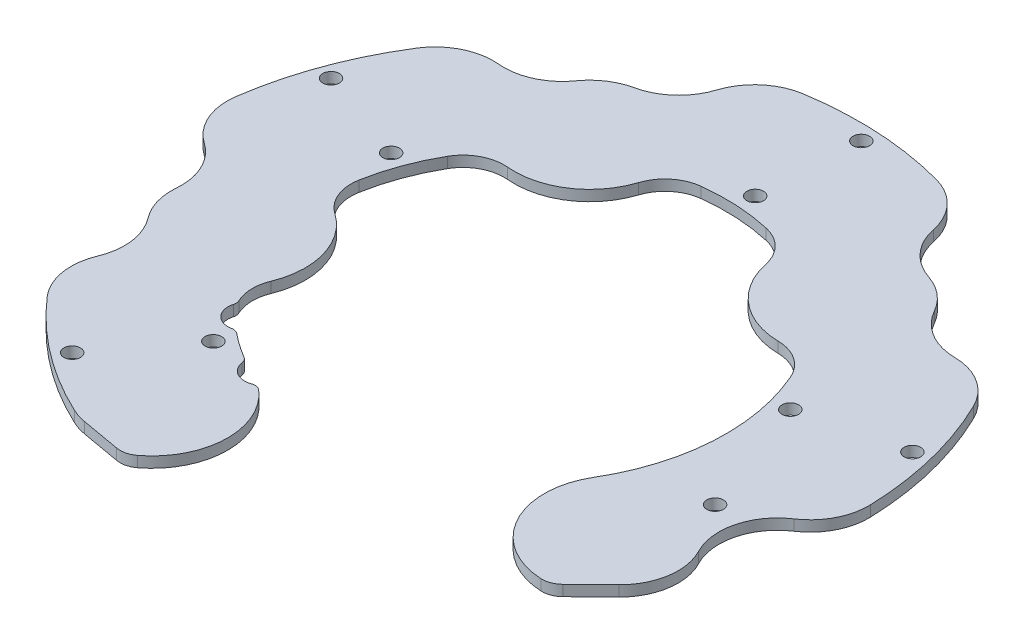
ISO-10303-21;
HEADER;
FILE_DESCRIPTION(('STEP AP214'),'2;1');
FILE_NAME('part.step','',(''),(''),'','','');
FILE_SCHEMA(('AUTOMOTIVE_DESIGN { 1 0 10303 214 1 1 1 1 }'));
ENDSEC;
DATA;
#1=APPLICATION_CONTEXT('core data for automotive mechanical design processes');
#2=APPLICATION_PROTOCOL_DEFINITION('international standard','automotive_design',2000,#1);
#3=PRODUCT_CONTEXT('',#1,'mechanical');
#4=PRODUCT('Part','Part','',(#3));
#5=PRODUCT_RELATED_PRODUCT_CATEGORY('part','',(#4));
#6=PRODUCT_DEFINITION_FORMATION('','',#4);
#7=PRODUCT_DEFINITION_CONTEXT('part definition',#1,'design');
#8=PRODUCT_DEFINITION('design','',#6,#7);
#9=PRODUCT_DEFINITION_SHAPE('','',#8);
#10=(LENGTH_UNIT() NAMED_UNIT(*) SI_UNIT(.MILLI.,.METRE.));
#11=(NAMED_UNIT(*) PLANE_ANGLE_UNIT() SI_UNIT($,.RADIAN.));
#12=(NAMED_UNIT(*) SI_UNIT($,.STERADIAN.) SOLID_ANGLE_UNIT());
#13=UNCERTAINTY_MEASURE_WITH_UNIT(LENGTH_MEASURE(1.E-05),#10,'distance_accuracy_value','');
#14=(GEOMETRIC_REPRESENTATION_CONTEXT(3) GLOBAL_UNCERTAINTY_ASSIGNED_CONTEXT((#13)) GLOBAL_UNIT_ASSIGNED_CONTEXT((#10,
#11,#12)) REPRESENTATION_CONTEXT('',''));
#15=CARTESIAN_POINT('',(0.,0.,0.));
#16=DIRECTION('',(0.,0.,1.));
#17=DIRECTION('',(1.,0.,0.));
#18=AXIS2_PLACEMENT_3D('',#15,#16,#17);
#19=CARTESIAN_POINT('',(-34.8871375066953,3.175,74.8157078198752));
#20=DIRECTION('',(0.,-1.,0.));
#21=DIRECTION('',(0.,0.,-1.));
#22=AXIS2_PLACEMENT_3D('',#19,#20,#21);
#23=CYLINDRICAL_SURFACE('',#22,17.272);
#24=DIRECTION('',(0.,1.,0.));
#25=VECTOR('',#24,1.);
#26=CARTESIAN_POINT('',(-37.8863888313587,-217.055004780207,91.825307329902));
#27=LINE('',#26,#25);
#28=CARTESIAN_POINT('',(-37.8863888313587,0.,91.825307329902));
#29=VERTEX_POINT('',#28);
#30=CARTESIAN_POINT('',(-37.8863888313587,3.175,91.825307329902));
#31=VERTEX_POINT('',#30);
#32=EDGE_CURVE('E50',#29,#31,#27,.T.);
#33=ORIENTED_EDGE('',*,*,#32,.T.);
#34=CARTESIAN_POINT('',(-34.8871375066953,3.175,74.8157078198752));
#35=DIRECTION('',(0.,1.,0.));
#36=DIRECTION('',(0.,0.,1.));
#37=AXIS2_PLACEMENT_3D('',#34,#35,#36);
#38=CIRCLE('',#37,17.272);
#39=CARTESIAN_POINT('',(-42.1866001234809,3.175,90.4694559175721));
#40=VERTEX_POINT('',#39);
#41=EDGE_CURVE('E532',#40,#31,#38,.T.);
#42=ORIENTED_EDGE('',*,*,#41,.F.);
#43=DIRECTION('',(0.,-1.,0.));
#44=VECTOR('',#43,1.);
#45=CARTESIAN_POINT('',(-42.1866001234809,3.175,90.4694559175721));
#46=LINE('',#45,#44);
#47=CARTESIAN_POINT('',(-42.1866001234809,0.,90.4694559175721));
#48=VERTEX_POINT('',#47);
#49=EDGE_CURVE('E534',#40,#48,#46,.T.);
#50=ORIENTED_EDGE('',*,*,#49,.T.);
#51=CARTESIAN_POINT('',(-34.8871375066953,0.,74.8157078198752));
#52=DIRECTION('',(0.,1.,0.));
#53=DIRECTION('',(0.,0.,1.));
#54=AXIS2_PLACEMENT_3D('',#51,#52,#53);
#55=CIRCLE('',#54,17.272);
#56=EDGE_CURVE('E490',#48,#29,#55,.T.);
#57=ORIENTED_EDGE('',*,*,#56,.T.);
#58=EDGE_LOOP('',(#33,#42,#50,#57));
#59=FACE_BOUND('',#58,.T.);
#60=ADVANCED_FACE('F35',(#59),#23,.T.);
#61=CARTESIAN_POINT('',(70.9491541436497,3.175,42.1985784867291));
#62=DIRECTION('',(0.,-1.,0.));
#63=DIRECTION('',(0.,0.,-1.));
#64=AXIS2_PLACEMENT_3D('',#61,#62,#63);
#65=CYLINDRICAL_SURFACE('',#64,17.272);
#66=CARTESIAN_POINT('',(70.9491541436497,3.175,42.1985784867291));
#67=DIRECTION('',(0.,1.,0.));
#68=DIRECTION('',(0.,0.,1.));
#69=AXIS2_PLACEMENT_3D('',#66,#67,#68);
#70=CIRCLE('',#69,17.272);
#71=CARTESIAN_POINT('',(83.0029020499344,3.175,54.569073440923));
#72=VERTEX_POINT('',#71);
#73=CARTESIAN_POINT('',(86.2498017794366,3.175,34.1853290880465));
#74=VERTEX_POINT('',#73);
#75=EDGE_CURVE('E58',#72,#74,#70,.T.);
#76=ORIENTED_EDGE('',*,*,#75,.F.);
#77=DIRECTION('',(0.,1.,0.));
#78=VECTOR('',#77,1.);
#79=CARTESIAN_POINT('',(83.0029020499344,-217.055004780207,54.569073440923));
#80=LINE('',#79,#78);
#81=CARTESIAN_POINT('',(83.0029020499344,0.,54.569073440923));
#82=VERTEX_POINT('',#81);
#83=EDGE_CURVE('E383',#82,#72,#80,.T.);
#84=ORIENTED_EDGE('',*,*,#83,.F.);
#85=CARTESIAN_POINT('',(70.9491541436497,0.,42.1985784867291));
#86=DIRECTION('',(0.,1.,0.));
#87=DIRECTION('',(0.,0.,1.));
#88=AXIS2_PLACEMENT_3D('',#85,#86,#87);
#89=CIRCLE('',#88,17.272);
#90=CARTESIAN_POINT('',(86.2498017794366,0.,34.1853290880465));
#91=VERTEX_POINT('',#90);
#92=EDGE_CURVE('E487',#82,#91,#89,.T.);
#93=ORIENTED_EDGE('',*,*,#92,.T.);
#94=DIRECTION('',(0.,-1.,0.));
#95=VECTOR('',#94,1.);
#96=CARTESIAN_POINT('',(86.2498017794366,3.175,34.1853290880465));
#97=LINE('',#96,#95);
#98=EDGE_CURVE('E11',#74,#91,#97,.T.);
#99=ORIENTED_EDGE('',*,*,#98,.F.);
#100=EDGE_LOOP('',(#76,#84,#93,#99));
#101=FACE_BOUND('',#100,.T.);
#102=ADVANCED_FACE('F37',(#101),#65,.T.);
#103=CARTESIAN_POINT('',(101.550449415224,3.175,26.1720796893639));
#104=DIRECTION('',(0.,-1.,0.));
#105=DIRECTION('',(0.,0.,-1.));
#106=AXIS2_PLACEMENT_3D('',#103,#104,#105);
#107=CYLINDRICAL_SURFACE('',#106,17.272);
#108=CARTESIAN_POINT('',(101.550449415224,0.,26.1720796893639));
#109=DIRECTION('',(0.,-1.,0.));
#110=DIRECTION('',(0.,0.,1.));
#111=AXIS2_PLACEMENT_3D('',#108,#109,#110);
#112=CIRCLE('',#111,17.272);
#113=CARTESIAN_POINT('',(92.0289681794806,0.,11.7615495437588));
#114=VERTEX_POINT('',#113);
#115=EDGE_CURVE('E536',#91,#114,#112,.T.);
#116=ORIENTED_EDGE('',*,*,#115,.T.);
#117=DIRECTION('',(0.,-1.,0.));
#118=VECTOR('',#117,1.);
#119=CARTESIAN_POINT('',(92.0289681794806,3.175,11.7615495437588));
#120=LINE('',#119,#118);
#121=CARTESIAN_POINT('',(92.0289681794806,3.175,11.7615495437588));
#122=VERTEX_POINT('',#121);
#123=EDGE_CURVE('E43',#122,#114,#120,.T.);
#124=ORIENTED_EDGE('',*,*,#123,.F.);
#125=CARTESIAN_POINT('',(101.550449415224,3.175,26.1720796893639));
#126=DIRECTION('',(0.,-1.,0.));
#127=DIRECTION('',(0.,0.,1.));
#128=AXIS2_PLACEMENT_3D('',#125,#126,#127);
#129=CIRCLE('',#128,17.272);
#130=EDGE_CURVE('E489',#74,#122,#129,.T.);
#131=ORIENTED_EDGE('',*,*,#130,.F.);
#132=ORIENTED_EDGE('',*,*,#98,.T.);
#133=EDGE_LOOP('',(#116,#124,#131,#132));
#134=FACE_BOUND('',#133,.T.);
#135=ADVANCED_FACE('F663',(#134),#107,.F.);
#136=CARTESIAN_POINT('',(82.5074869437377,3.175,-2.64898060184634));
#137=DIRECTION('',(0.,-1.,0.));
#138=DIRECTION('',(0.,0.,-1.));
#139=AXIS2_PLACEMENT_3D('',#136,#137,#138);
#140=CYLINDRICAL_SURFACE('',#139,17.272);
#141=CARTESIAN_POINT('',(82.5074869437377,0.,-2.64898060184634));
#142=DIRECTION('',(0.,1.,0.));
#143=DIRECTION('',(0.,0.,1.));
#144=AXIS2_PLACEMENT_3D('',#141,#142,#143);
#145=CIRCLE('',#144,17.272);
#146=CARTESIAN_POINT('',(99.7705919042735,0.,-3.20322885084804));
#147=VERTEX_POINT('',#146);
#148=EDGE_CURVE('E538',#114,#147,#145,.T.);
#149=ORIENTED_EDGE('',*,*,#148,.T.);
#150=DIRECTION('',(0.,-1.,0.));
#151=VECTOR('',#150,1.);
#152=CARTESIAN_POINT('',(99.7705919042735,3.175,-3.20322885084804));
#153=LINE('',#152,#151);
#154=CARTESIAN_POINT('',(99.7705919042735,3.175,-3.20322885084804));
#155=VERTEX_POINT('',#154);
#156=EDGE_CURVE('E635',#155,#147,#153,.T.);
#157=ORIENTED_EDGE('',*,*,#156,.F.);
#158=CARTESIAN_POINT('',(82.5074869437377,3.175,-2.64898060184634));
#159=DIRECTION('',(0.,1.,0.));
#160=DIRECTION('',(0.,0.,1.));
#161=AXIS2_PLACEMENT_3D('',#158,#159,#160);
#162=CIRCLE('',#161,17.272);
#163=EDGE_CURVE('E492',#122,#155,#162,.T.);
#164=ORIENTED_EDGE('',*,*,#163,.F.);
#165=ORIENTED_EDGE('',*,*,#123,.T.);
#166=EDGE_LOOP('',(#149,#157,#164,#165));
#167=FACE_BOUND('',#166,.T.);
#168=ADVANCED_FACE('F642',(#167),#140,.T.);
#169=CARTESIAN_POINT('',(0.,3.175,0.));
#170=DIRECTION('',(0.,-1.,0.));
#171=DIRECTION('',(0.,0.,-1.));
#172=AXIS2_PLACEMENT_3D('',#169,#170,#171);
#173=CYLINDRICAL_SURFACE('',#172,99.822);
#174=CARTESIAN_POINT('',(0.,0.,0.));
#175=DIRECTION('',(0.,1.,0.));
#176=DIRECTION('',(0.,0.,1.));
#177=AXIS2_PLACEMENT_3D('',#174,#175,#176);
#178=CIRCLE('',#177,99.822);
#179=CARTESIAN_POINT('',(89.7244153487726,0.,-43.7488396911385));
#180=VERTEX_POINT('',#179);
#181=EDGE_CURVE('E540',#147,#180,#178,.T.);
#182=ORIENTED_EDGE('',*,*,#181,.T.);
#183=DIRECTION('',(0.,-1.,0.));
#184=VECTOR('',#183,1.);
#185=CARTESIAN_POINT('',(89.7244153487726,3.175,-43.7488396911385));
#186=LINE('',#185,#184);
#187=CARTESIAN_POINT('',(89.7244153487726,3.175,-43.7488396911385));
#188=VERTEX_POINT('',#187);
#189=EDGE_CURVE('E632',#188,#180,#186,.T.);
#190=ORIENTED_EDGE('',*,*,#189,.F.);
#191=CARTESIAN_POINT('',(0.,3.175,0.));
#192=DIRECTION('',(0.,1.,0.));
#193=DIRECTION('',(0.,0.,1.));
#194=AXIS2_PLACEMENT_3D('',#191,#192,#193);
#195=CIRCLE('',#194,99.822);
#196=EDGE_CURVE('E494',#155,#188,#195,.T.);
#197=ORIENTED_EDGE('',*,*,#196,.F.);
#198=ORIENTED_EDGE('',*,*,#156,.T.);
#199=EDGE_LOOP('',(#182,#190,#197,#198));
#200=FACE_BOUND('',#199,.T.);
#201=ADVANCED_FACE('F652',(#200),#173,.T.);
#202=CARTESIAN_POINT('',(74.1995801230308,3.175,-36.179065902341));
#203=DIRECTION('',(0.,-1.,0.));
#204=DIRECTION('',(0.,0.,-1.));
#205=AXIS2_PLACEMENT_3D('',#202,#203,#204);
#206=CYLINDRICAL_SURFACE('',#205,17.272);
#207=CARTESIAN_POINT('',(74.1995801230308,0.,-36.179065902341));
#208=DIRECTION('',(0.,1.,0.));
#209=DIRECTION('',(0.,0.,1.));
#210=AXIS2_PLACEMENT_3D('',#207,#208,#209);
#211=CIRCLE('',#210,17.272);
#212=CARTESIAN_POINT('',(74.4213557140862,0.,-53.449642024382));
#213=VERTEX_POINT('',#212);
#214=EDGE_CURVE('E542',#180,#213,#211,.T.);
#215=ORIENTED_EDGE('',*,*,#214,.T.);
#216=DIRECTION('',(0.,-1.,0.));
#217=VECTOR('',#216,1.);
#218=CARTESIAN_POINT('',(74.4213557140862,3.175,-53.449642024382));
#219=LINE('',#218,#217);
#220=CARTESIAN_POINT('',(74.4213557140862,3.175,-53.449642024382));
#221=VERTEX_POINT('',#220);
#222=EDGE_CURVE('E629',#221,#213,#219,.T.);
#223=ORIENTED_EDGE('',*,*,#222,.F.);
#224=CARTESIAN_POINT('',(74.1995801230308,3.175,-36.179065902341));
#225=DIRECTION('',(0.,1.,0.));
#226=DIRECTION('',(0.,0.,1.));
#227=AXIS2_PLACEMENT_3D('',#224,#225,#226);
#228=CIRCLE('',#227,17.272);
#229=EDGE_CURVE('E496',#188,#221,#228,.T.);
#230=ORIENTED_EDGE('',*,*,#229,.F.);
#231=ORIENTED_EDGE('',*,*,#189,.T.);
#232=EDGE_LOOP('',(#215,#223,#230,#231));
#233=FACE_BOUND('',#232,.T.);
#234=ADVANCED_FACE('F656',(#233),#206,.T.);
#235=CARTESIAN_POINT('',(74.6431313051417,3.175,-70.720218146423));
#236=DIRECTION('',(0.,-1.,0.));
#237=DIRECTION('',(0.,0.,-1.));
#238=AXIS2_PLACEMENT_3D('',#235,#236,#237);
#239=CYLINDRICAL_SURFACE('',#238,17.272);
#240=CARTESIAN_POINT('',(74.6431313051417,0.,-70.720218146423));
#241=DIRECTION('',(0.,-1.,0.));
#242=DIRECTION('',(0.,0.,1.));
#243=AXIS2_PLACEMENT_3D('',#240,#241,#242);
#244=CIRCLE('',#243,17.272);
#245=CARTESIAN_POINT('',(59.5754858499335,0.,-62.2769933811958));
#246=VERTEX_POINT('',#245);
#247=EDGE_CURVE('E544',#213,#246,#244,.T.);
#248=ORIENTED_EDGE('',*,*,#247,.T.);
#249=DIRECTION('',(0.,-1.,0.));
#250=VECTOR('',#249,1.);
#251=CARTESIAN_POINT('',(59.5754858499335,3.175,-62.2769933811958));
#252=LINE('',#251,#250);
#253=CARTESIAN_POINT('',(59.5754858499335,3.175,-62.2769933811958));
#254=VERTEX_POINT('',#253);
#255=EDGE_CURVE('E626',#254,#246,#252,.T.);
#256=ORIENTED_EDGE('',*,*,#255,.F.);
#257=CARTESIAN_POINT('',(74.6431313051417,3.175,-70.720218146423));
#258=DIRECTION('',(0.,-1.,0.));
#259=DIRECTION('',(0.,0.,1.));
#260=AXIS2_PLACEMENT_3D('',#257,#258,#259);
#261=CIRCLE('',#260,17.272);
#262=EDGE_CURVE('E498',#221,#254,#261,.T.);
#263=ORIENTED_EDGE('',*,*,#262,.F.);
#264=ORIENTED_EDGE('',*,*,#222,.T.);
#265=EDGE_LOOP('',(#248,#256,#263,#264));
#266=FACE_BOUND('',#265,.T.);
#267=ADVANCED_FACE('F975',(#266),#239,.F.);
#268=CARTESIAN_POINT('',(44.5078403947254,3.175,-53.8337686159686));
#269=DIRECTION('',(0.,-1.,0.));
#270=DIRECTION('',(0.,0.,-1.));
#271=AXIS2_PLACEMENT_3D('',#268,#269,#270);
#272=CYLINDRICAL_SURFACE('',#271,17.272);
#273=CARTESIAN_POINT('',(44.5078403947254,0.,-53.8337686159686));
#274=DIRECTION('',(0.,1.,0.));
#275=DIRECTION('',(0.,0.,1.));
#276=AXIS2_PLACEMENT_3D('',#273,#274,#275);
#277=CIRCLE('',#276,17.272);
#278=CARTESIAN_POINT('',(49.9682395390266,0.,-70.2199220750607));
#279=VERTEX_POINT('',#278);
#280=EDGE_CURVE('E546',#246,#279,#277,.T.);
#281=ORIENTED_EDGE('',*,*,#280,.T.);
#282=DIRECTION('',(0.,-1.,0.));
#283=VECTOR('',#282,1.);
#284=CARTESIAN_POINT('',(49.9682395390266,3.175,-70.2199220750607));
#285=LINE('',#284,#283);
#286=CARTESIAN_POINT('',(49.9682395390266,3.175,-70.2199220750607));
#287=VERTEX_POINT('',#286);
#288=EDGE_CURVE('E623',#287,#279,#285,.T.);
#289=ORIENTED_EDGE('',*,*,#288,.F.);
#290=CARTESIAN_POINT('',(44.5078403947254,3.175,-53.8337686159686));
#291=DIRECTION('',(0.,1.,0.));
#292=DIRECTION('',(0.,0.,1.));
#293=AXIS2_PLACEMENT_3D('',#290,#291,#292);
#294=CIRCLE('',#293,17.272);
#295=EDGE_CURVE('E500',#254,#287,#294,.T.);
#296=ORIENTED_EDGE('',*,*,#295,.F.);
#297=ORIENTED_EDGE('',*,*,#255,.T.);
#298=EDGE_LOOP('',(#281,#289,#296,#297));
#299=FACE_BOUND('',#298,.T.);
#300=ADVANCED_FACE('F971',(#299),#272,.T.);
#301=CARTESIAN_POINT('',(55.4286386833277,3.175,-86.6060755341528));
#302=DIRECTION('',(0.,-1.,0.));
#303=DIRECTION('',(0.,0.,-1.));
#304=AXIS2_PLACEMENT_3D('',#301,#302,#303);
#305=CYLINDRICAL_SURFACE('',#304,17.272);
#306=CARTESIAN_POINT('',(55.4286386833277,0.,-86.6060755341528));
#307=DIRECTION('',(0.,-1.,0.));
#308=DIRECTION('',(0.,0.,1.));
#309=AXIS2_PLACEMENT_3D('',#306,#307,#308);
#310=CIRCLE('',#309,17.272);
#311=CARTESIAN_POINT('',(38.5076139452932,0.,-83.1418431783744));
#312=VERTEX_POINT('',#311);
#313=EDGE_CURVE('E548',#279,#312,#310,.T.);
#314=ORIENTED_EDGE('',*,*,#313,.T.);
#315=DIRECTION('',(0.,-1.,0.));
#316=VECTOR('',#315,1.);
#317=CARTESIAN_POINT('',(38.5076139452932,3.175,-83.1418431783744));
#318=LINE('',#317,#316);
#319=CARTESIAN_POINT('',(38.5076139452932,3.175,-83.1418431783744));
#320=VERTEX_POINT('',#319);
#321=EDGE_CURVE('E620',#320,#312,#318,.T.);
#322=ORIENTED_EDGE('',*,*,#321,.F.);
#323=CARTESIAN_POINT('',(55.4286386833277,3.175,-86.6060755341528));
#324=DIRECTION('',(0.,-1.,0.));
#325=DIRECTION('',(0.,0.,1.));
#326=AXIS2_PLACEMENT_3D('',#323,#324,#325);
#327=CIRCLE('',#326,17.272);
#328=EDGE_CURVE('E502',#287,#320,#327,.T.);
#329=ORIENTED_EDGE('',*,*,#328,.F.);
#330=ORIENTED_EDGE('',*,*,#288,.T.);
#331=EDGE_LOOP('',(#314,#322,#329,#330));
#332=FACE_BOUND('',#331,.T.);
#333=ADVANCED_FACE('F967',(#332),#305,.F.);
#334=CARTESIAN_POINT('',(21.5865892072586,3.175,-79.677610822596));
#335=DIRECTION('',(0.,-1.,0.));
#336=DIRECTION('',(0.,0.,-1.));
#337=AXIS2_PLACEMENT_3D('',#334,#335,#336);
#338=CYLINDRICAL_SURFACE('',#337,17.272);
#339=CARTESIAN_POINT('',(21.5865892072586,0.,-79.677610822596));
#340=DIRECTION('',(0.,1.,0.));
#341=DIRECTION('',(0.,0.,1.));
#342=AXIS2_PLACEMENT_3D('',#339,#340,#341);
#343=CIRCLE('',#342,17.272);
#344=CARTESIAN_POINT('',(26.1031678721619,0.,-96.3486186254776));
#345=VERTEX_POINT('',#344);
#346=EDGE_CURVE('E550',#312,#345,#343,.T.);
#347=ORIENTED_EDGE('',*,*,#346,.T.);
#348=DIRECTION('',(0.,-1.,0.));
#349=VECTOR('',#348,1.);
#350=CARTESIAN_POINT('',(26.1031678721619,3.175,-96.3486186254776));
#351=LINE('',#350,#349);
#352=CARTESIAN_POINT('',(26.1031678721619,3.175,-96.3486186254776));
#353=VERTEX_POINT('',#352);
#354=EDGE_CURVE('E617',#353,#345,#351,.T.);
#355=ORIENTED_EDGE('',*,*,#354,.F.);
#356=CARTESIAN_POINT('',(21.5865892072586,3.175,-79.677610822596));
#357=DIRECTION('',(0.,1.,0.));
#358=DIRECTION('',(0.,0.,1.));
#359=AXIS2_PLACEMENT_3D('',#356,#357,#358);
#360=CIRCLE('',#359,17.272);
#361=EDGE_CURVE('E504',#320,#353,#360,.T.);
#362=ORIENTED_EDGE('',*,*,#361,.F.);
#363=ORIENTED_EDGE('',*,*,#321,.T.);
#364=EDGE_LOOP('',(#347,#355,#362,#363));
#365=FACE_BOUND('',#364,.T.);
#366=ADVANCED_FACE('F963',(#365),#338,.T.);
#367=CARTESIAN_POINT('',(0.,3.175,0.));
#368=DIRECTION('',(0.,-1.,0.));
#369=DIRECTION('',(0.,0.,-1.));
#370=AXIS2_PLACEMENT_3D('',#367,#368,#369);
#371=CYLINDRICAL_SURFACE('',#370,99.822);
#372=CARTESIAN_POINT('',(0.,0.,0.));
#373=DIRECTION('',(0.,1.,0.));
#374=DIRECTION('',(0.,0.,1.));
#375=AXIS2_PLACEMENT_3D('',#372,#373,#374);
#376=CIRCLE('',#375,99.822);
#377=CARTESIAN_POINT('',(-15.6080958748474,0.,-98.5942139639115));
#378=VERTEX_POINT('',#377);
#379=EDGE_CURVE('E552',#345,#378,#376,.T.);
#380=ORIENTED_EDGE('',*,*,#379,.T.);
#381=DIRECTION('',(0.,-1.,0.));
#382=VECTOR('',#381,1.);
#383=CARTESIAN_POINT('',(-15.6080958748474,3.175,-98.5942139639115));
#384=LINE('',#383,#382);
#385=CARTESIAN_POINT('',(-15.6080958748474,3.175,-98.5942139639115));
#386=VERTEX_POINT('',#385);
#387=EDGE_CURVE('E614',#386,#378,#384,.T.);
#388=ORIENTED_EDGE('',*,*,#387,.F.);
#389=CARTESIAN_POINT('',(0.,3.175,0.));
#390=DIRECTION('',(0.,1.,0.));
#391=DIRECTION('',(0.,0.,1.));
#392=AXIS2_PLACEMENT_3D('',#389,#390,#391);
#393=CIRCLE('',#392,99.822);
#394=EDGE_CURVE('E506',#353,#386,#393,.T.);
#395=ORIENTED_EDGE('',*,*,#394,.F.);
#396=ORIENTED_EDGE('',*,*,#354,.T.);
#397=EDGE_LOOP('',(#380,#388,#395,#396));
#398=FACE_BOUND('',#397,.T.);
#399=ADVANCED_FACE('F959',(#398),#371,.T.);
#400=CARTESIAN_POINT('',(-12.9074584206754,3.175,-81.5346553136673));
#401=DIRECTION('',(0.,-1.,0.));
#402=DIRECTION('',(0.,0.,-1.));
#403=AXIS2_PLACEMENT_3D('',#400,#401,#402);
#404=CYLINDRICAL_SURFACE('',#403,17.272);
#405=CARTESIAN_POINT('',(-12.9074584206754,0.,-81.5346553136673));
#406=DIRECTION('',(0.,1.,0.));
#407=DIRECTION('',(0.,0.,1.));
#408=AXIS2_PLACEMENT_3D('',#405,#406,#407);
#409=CIRCLE('',#408,17.272);
#410=CARTESIAN_POINT('',(-29.3587518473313,0.,-86.7955419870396));
#411=VERTEX_POINT('',#410);
#412=EDGE_CURVE('E554',#378,#411,#409,.T.);
#413=ORIENTED_EDGE('',*,*,#412,.T.);
#414=DIRECTION('',(0.,-1.,0.));
#415=VECTOR('',#414,1.);
#416=CARTESIAN_POINT('',(-29.3587518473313,3.175,-86.7955419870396));
#417=LINE('',#416,#415);
#418=CARTESIAN_POINT('',(-29.3587518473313,3.175,-86.7955419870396));
#419=VERTEX_POINT('',#418);
#420=EDGE_CURVE('E611',#419,#411,#417,.T.);
#421=ORIENTED_EDGE('',*,*,#420,.F.);
#422=CARTESIAN_POINT('',(-12.9074584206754,3.175,-81.5346553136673));
#423=DIRECTION('',(0.,1.,0.));
#424=DIRECTION('',(0.,0.,1.));
#425=AXIS2_PLACEMENT_3D('',#422,#423,#424);
#426=CIRCLE('',#425,17.272);
#427=EDGE_CURVE('E508',#386,#419,#426,.T.);
#428=ORIENTED_EDGE('',*,*,#427,.F.);
#429=ORIENTED_EDGE('',*,*,#387,.T.);
#430=EDGE_LOOP('',(#413,#421,#428,#429));
#431=FACE_BOUND('',#430,.T.);
#432=ADVANCED_FACE('F955',(#431),#404,.T.);
#433=CARTESIAN_POINT('',(-45.8100452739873,3.175,-92.0564286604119));
#434=DIRECTION('',(0.,-1.,0.));
#435=DIRECTION('',(0.,0.,-1.));
#436=AXIS2_PLACEMENT_3D('',#433,#434,#435);
#437=CYLINDRICAL_SURFACE('',#436,17.272);
#438=CARTESIAN_POINT('',(-45.8100452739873,0.,-92.0564286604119));
#439=DIRECTION('',(0.,-1.,0.));
#440=DIRECTION('',(0.,0.,1.));
#441=AXIS2_PLACEMENT_3D('',#438,#439,#440);
#442=CIRCLE('',#441,17.272);
#443=CARTESIAN_POINT('',(-42.1404600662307,0.,-75.1787472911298));
#444=VERTEX_POINT('',#443);
#445=EDGE_CURVE('E556',#411,#444,#442,.T.);
#446=ORIENTED_EDGE('',*,*,#445,.T.);
#447=DIRECTION('',(0.,-1.,0.));
#448=VECTOR('',#447,1.);
#449=CARTESIAN_POINT('',(-42.1404600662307,3.175,-75.1787472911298));
#450=LINE('',#449,#448);
#451=CARTESIAN_POINT('',(-42.1404600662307,3.175,-75.1787472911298));
#452=VERTEX_POINT('',#451);
#453=EDGE_CURVE('E608',#452,#444,#450,.T.);
#454=ORIENTED_EDGE('',*,*,#453,.F.);
#455=CARTESIAN_POINT('',(-45.8100452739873,3.175,-92.0564286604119));
#456=DIRECTION('',(0.,-1.,0.));
#457=DIRECTION('',(0.,0.,1.));
#458=AXIS2_PLACEMENT_3D('',#455,#456,#457);
#459=CIRCLE('',#458,17.272);
#460=EDGE_CURVE('E510',#419,#452,#459,.T.);
#461=ORIENTED_EDGE('',*,*,#460,.F.);
#462=ORIENTED_EDGE('',*,*,#420,.T.);
#463=EDGE_LOOP('',(#446,#454,#461,#462));
#464=FACE_BOUND('',#463,.T.);
#465=ADVANCED_FACE('F951',(#464),#437,.F.);
#466=CARTESIAN_POINT('',(-38.4708748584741,3.175,-58.3010659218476));
#467=DIRECTION('',(0.,-1.,0.));
#468=DIRECTION('',(0.,0.,-1.));
#469=AXIS2_PLACEMENT_3D('',#466,#467,#468);
#470=CYLINDRICAL_SURFACE('',#469,17.272);
#471=CARTESIAN_POINT('',(-38.4708748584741,0.,-58.3010659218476));
#472=DIRECTION('',(0.,1.,0.));
#473=DIRECTION('',(0.,0.,1.));
#474=AXIS2_PLACEMENT_3D('',#471,#472,#473);
#475=CIRCLE('',#474,17.272);
#476=CARTESIAN_POINT('',(-52.5449462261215,0.,-68.3131835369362));
#477=VERTEX_POINT('',#476);
#478=EDGE_CURVE('E558',#444,#477,#475,.T.);
#479=ORIENTED_EDGE('',*,*,#478,.T.);
#480=DIRECTION('',(0.,-1.,0.));
#481=VECTOR('',#480,1.);
#482=CARTESIAN_POINT('',(-52.5449462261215,3.175,-68.3131835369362));
#483=LINE('',#482,#481);
#484=CARTESIAN_POINT('',(-52.5449462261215,3.175,-68.3131835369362));
#485=VERTEX_POINT('',#484);
#486=EDGE_CURVE('E605',#485,#477,#483,.T.);
#487=ORIENTED_EDGE('',*,*,#486,.F.);
#488=CARTESIAN_POINT('',(-38.4708748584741,3.175,-58.3010659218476));
#489=DIRECTION('',(0.,1.,0.));
#490=DIRECTION('',(0.,0.,1.));
#491=AXIS2_PLACEMENT_3D('',#488,#489,#490);
#492=CIRCLE('',#491,17.272);
#493=EDGE_CURVE('E512',#452,#485,#492,.T.);
#494=ORIENTED_EDGE('',*,*,#493,.F.);
#495=ORIENTED_EDGE('',*,*,#453,.T.);
#496=EDGE_LOOP('',(#479,#487,#494,#495));
#497=FACE_BOUND('',#496,.T.);
#498=ADVANCED_FACE('F947',(#497),#470,.T.);
#499=CARTESIAN_POINT('',(-66.619017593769,3.175,-78.3253011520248));
#500=DIRECTION('',(0.,-1.,0.));
#501=DIRECTION('',(0.,0.,-1.));
#502=AXIS2_PLACEMENT_3D('',#499,#500,#501);
#503=CYLINDRICAL_SURFACE('',#502,17.272);
#504=CARTESIAN_POINT('',(-66.619017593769,0.,-78.3253011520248));
#505=DIRECTION('',(0.,-1.,0.));
#506=DIRECTION('',(0.,0.,1.));
#507=AXIS2_PLACEMENT_3D('',#504,#505,#506);
#508=CIRCLE('',#507,17.272);
#509=CARTESIAN_POINT('',(-68.2527301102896,0.,-61.1307390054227));
#510=VERTEX_POINT('',#509);
#511=EDGE_CURVE('E560',#477,#510,#508,.T.);
#512=ORIENTED_EDGE('',*,*,#511,.T.);
#513=DIRECTION('',(0.,-1.,0.));
#514=VECTOR('',#513,1.);
#515=CARTESIAN_POINT('',(-68.2527301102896,3.175,-61.1307390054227));
#516=LINE('',#515,#514);
#517=CARTESIAN_POINT('',(-68.2527301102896,3.175,-61.1307390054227));
#518=VERTEX_POINT('',#517);
#519=EDGE_CURVE('E602',#518,#510,#516,.T.);
#520=ORIENTED_EDGE('',*,*,#519,.F.);
#521=CARTESIAN_POINT('',(-66.619017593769,3.175,-78.3253011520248));
#522=DIRECTION('',(0.,-1.,0.));
#523=DIRECTION('',(0.,0.,1.));
#524=AXIS2_PLACEMENT_3D('',#521,#522,#523);
#525=CIRCLE('',#524,17.272);
#526=EDGE_CURVE('E514',#485,#518,#525,.T.);
#527=ORIENTED_EDGE('',*,*,#526,.F.);
#528=ORIENTED_EDGE('',*,*,#486,.T.);
#529=EDGE_LOOP('',(#512,#520,#527,#528));
#530=FACE_BOUND('',#529,.T.);
#531=ADVANCED_FACE('F943',(#530),#503,.F.);
#532=CARTESIAN_POINT('',(-69.8864426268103,3.175,-43.9361768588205));
#533=DIRECTION('',(0.,-1.,0.));
#534=DIRECTION('',(0.,0.,-1.));
#535=AXIS2_PLACEMENT_3D('',#532,#533,#534);
#536=CYLINDRICAL_SURFACE('',#535,17.272);
#537=CARTESIAN_POINT('',(-69.8864426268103,0.,-43.9361768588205));
#538=DIRECTION('',(0.,1.,0.));
#539=DIRECTION('',(0.,0.,1.));
#540=AXIS2_PLACEMENT_3D('',#537,#538,#539);
#541=CIRCLE('',#540,17.272);
#542=CARTESIAN_POINT('',(-84.5088367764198,0.,-53.1289769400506));
#543=VERTEX_POINT('',#542);
#544=EDGE_CURVE('E562',#510,#543,#541,.T.);
#545=ORIENTED_EDGE('',*,*,#544,.T.);
#546=DIRECTION('',(0.,-1.,0.));
#547=VECTOR('',#546,1.);
#548=CARTESIAN_POINT('',(-84.5088367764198,3.175,-53.1289769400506));
#549=LINE('',#548,#547);
#550=CARTESIAN_POINT('',(-84.5088367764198,3.175,-53.1289769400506));
#551=VERTEX_POINT('',#550);
#552=EDGE_CURVE('E599',#551,#543,#549,.T.);
#553=ORIENTED_EDGE('',*,*,#552,.F.);
#554=CARTESIAN_POINT('',(-69.8864426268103,3.175,-43.9361768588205));
#555=DIRECTION('',(0.,1.,0.));
#556=DIRECTION('',(0.,0.,1.));
#557=AXIS2_PLACEMENT_3D('',#554,#555,#556);
#558=CIRCLE('',#557,17.272);
#559=EDGE_CURVE('E516',#518,#551,#558,.T.);
#560=ORIENTED_EDGE('',*,*,#559,.F.);
#561=ORIENTED_EDGE('',*,*,#519,.T.);
#562=EDGE_LOOP('',(#545,#553,#560,#561));
#563=FACE_BOUND('',#562,.T.);
#564=ADVANCED_FACE('F939',(#563),#536,.T.);
#565=CARTESIAN_POINT('',(0.,3.175,0.));
#566=DIRECTION('',(0.,-1.,0.));
#567=DIRECTION('',(0.,0.,-1.));
#568=AXIS2_PLACEMENT_3D('',#565,#566,#567);
#569=CYLINDRICAL_SURFACE('',#568,99.822);
#570=CARTESIAN_POINT('',(0.,0.,0.));
#571=DIRECTION('',(0.,1.,0.));
#572=DIRECTION('',(0.,0.,1.));
#573=AXIS2_PLACEMENT_3D('',#570,#571,#572);
#574=CIRCLE('',#573,99.822);
#575=CARTESIAN_POINT('',(-98.8500103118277,0.,-13.8962996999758));
#576=VERTEX_POINT('',#575);
#577=EDGE_CURVE('E564',#543,#576,#574,.T.);
#578=ORIENTED_EDGE('',*,*,#577,.T.);
#579=DIRECTION('',(0.,-1.,0.));
#580=VECTOR('',#579,1.);
#581=CARTESIAN_POINT('',(-98.8500103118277,3.175,-13.8962996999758));
#582=LINE('',#581,#580);
#583=CARTESIAN_POINT('',(-98.8500103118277,3.175,-13.8962996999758));
#584=VERTEX_POINT('',#583);
#585=EDGE_CURVE('E596',#584,#576,#582,.T.);
#586=ORIENTED_EDGE('',*,*,#585,.F.);
#587=CARTESIAN_POINT('',(0.,3.175,0.));
#588=DIRECTION('',(0.,1.,0.));
#589=DIRECTION('',(0.,0.,1.));
#590=AXIS2_PLACEMENT_3D('',#587,#588,#589);
#591=CIRCLE('',#590,99.822);
#592=EDGE_CURVE('E518',#551,#584,#591,.T.);
#593=ORIENTED_EDGE('',*,*,#592,.F.);
#594=ORIENTED_EDGE('',*,*,#552,.T.);
#595=EDGE_LOOP('',(#578,#586,#593,#594));
#596=FACE_BOUND('',#595,.T.);
#597=ADVANCED_FACE('F935',(#596),#569,.T.);
#598=CARTESIAN_POINT('',(-81.7461917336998,3.175,-11.4918508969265));
#599=DIRECTION('',(0.,-1.,0.));
#600=DIRECTION('',(0.,0.,-1.));
#601=AXIS2_PLACEMENT_3D('',#598,#599,#600);
#602=CYLINDRICAL_SURFACE('',#601,17.272);
#603=CARTESIAN_POINT('',(-81.7461917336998,0.,-11.4918508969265));
#604=DIRECTION('',(0.,1.,0.));
#605=DIRECTION('',(0.,0.,1.));
#606=AXIS2_PLACEMENT_3D('',#603,#604,#605);
#607=CIRCLE('',#606,17.272);
#608=CARTESIAN_POINT('',(-91.5865551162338,0.,2.70283939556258));
#609=VERTEX_POINT('',#608);
#610=EDGE_CURVE('E566',#576,#609,#607,.T.);
#611=ORIENTED_EDGE('',*,*,#610,.T.);
#612=DIRECTION('',(0.,-1.,0.));
#613=VECTOR('',#612,1.);
#614=CARTESIAN_POINT('',(-91.5865551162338,3.175,2.70283939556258));
#615=LINE('',#614,#613);
#616=CARTESIAN_POINT('',(-91.5865551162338,3.175,2.70283939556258));
#617=VERTEX_POINT('',#616);
#618=EDGE_CURVE('E593',#617,#609,#615,.T.);
#619=ORIENTED_EDGE('',*,*,#618,.F.);
#620=CARTESIAN_POINT('',(-81.7461917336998,3.175,-11.4918508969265));
#621=DIRECTION('',(0.,1.,0.));
#622=DIRECTION('',(0.,0.,1.));
#623=AXIS2_PLACEMENT_3D('',#620,#621,#622);
#624=CIRCLE('',#623,17.272);
#625=EDGE_CURVE('E520',#584,#617,#624,.T.);
#626=ORIENTED_EDGE('',*,*,#625,.F.);
#627=ORIENTED_EDGE('',*,*,#585,.T.);
#628=EDGE_LOOP('',(#611,#619,#626,#627));
#629=FACE_BOUND('',#628,.T.);
#630=ADVANCED_FACE('F931',(#629),#602,.T.);
#631=CARTESIAN_POINT('',(-101.426918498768,3.175,16.8975296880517));
#632=DIRECTION('',(0.,-1.,0.));
#633=DIRECTION('',(0.,0.,-1.));
#634=AXIS2_PLACEMENT_3D('',#631,#632,#633);
#635=CYLINDRICAL_SURFACE('',#634,17.272);
#636=CARTESIAN_POINT('',(-101.426918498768,0.,16.8975296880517));
#637=DIRECTION('',(0.,-1.,0.));
#638=DIRECTION('',(0.,0.,-1.));
#639=AXIS2_PLACEMENT_3D('',#636,#637,#638);
#640=CIRCLE('',#639,17.272);
#641=CARTESIAN_POINT('',(-84.2137744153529,0.,18.3221892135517));
#642=VERTEX_POINT('',#641);
#643=EDGE_CURVE('E568',#609,#642,#640,.T.);
#644=ORIENTED_EDGE('',*,*,#643,.T.);
#645=DIRECTION('',(0.,-1.,0.));
#646=VECTOR('',#645,1.);
#647=CARTESIAN_POINT('',(-84.2137744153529,3.175,18.3221892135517));
#648=LINE('',#647,#646);
#649=CARTESIAN_POINT('',(-84.2137744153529,3.175,18.3221892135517));
#650=VERTEX_POINT('',#649);
#651=EDGE_CURVE('E590',#650,#642,#648,.T.);
#652=ORIENTED_EDGE('',*,*,#651,.F.);
#653=CARTESIAN_POINT('',(-101.426918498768,3.175,16.8975296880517));
#654=DIRECTION('',(0.,-1.,0.));
#655=DIRECTION('',(0.,0.,-1.));
#656=AXIS2_PLACEMENT_3D('',#653,#654,#655);
#657=CIRCLE('',#656,17.272);
#658=EDGE_CURVE('E522',#617,#650,#657,.T.);
#659=ORIENTED_EDGE('',*,*,#658,.F.);
#660=ORIENTED_EDGE('',*,*,#618,.T.);
#661=EDGE_LOOP('',(#644,#652,#659,#660));
#662=FACE_BOUND('',#661,.T.);
#663=ADVANCED_FACE('F927',(#662),#635,.F.);
#664=CARTESIAN_POINT('',(-67.000630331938,3.175,19.7468487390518));
#665=DIRECTION('',(0.,-1.,0.));
#666=DIRECTION('',(0.,0.,-1.));
#667=AXIS2_PLACEMENT_3D('',#664,#665,#666);
#668=CYLINDRICAL_SURFACE('',#667,17.272);
#669=CARTESIAN_POINT('',(-67.000630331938,0.,19.7468487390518));
#670=DIRECTION('',(0.,1.,0.));
#671=DIRECTION('',(0.,0.,1.));
#672=AXIS2_PLACEMENT_3D('',#669,#670,#671);
#673=CIRCLE('',#672,17.272);
#674=CARTESIAN_POINT('',(-80.6897253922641,0.,30.2792112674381));
#675=VERTEX_POINT('',#674);
#676=EDGE_CURVE('E570',#642,#675,#673,.T.);
#677=ORIENTED_EDGE('',*,*,#676,.T.);
#678=DIRECTION('',(0.,-1.,0.));
#679=VECTOR('',#678,1.);
#680=CARTESIAN_POINT('',(-80.6897253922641,3.175,30.2792112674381));
#681=LINE('',#680,#679);
#682=CARTESIAN_POINT('',(-80.6897253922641,3.175,30.2792112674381));
#683=VERTEX_POINT('',#682);
#684=EDGE_CURVE('E587',#683,#675,#681,.T.);
#685=ORIENTED_EDGE('',*,*,#684,.F.);
#686=CARTESIAN_POINT('',(-67.000630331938,3.175,19.7468487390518));
#687=DIRECTION('',(0.,1.,0.));
#688=DIRECTION('',(0.,0.,1.));
#689=AXIS2_PLACEMENT_3D('',#686,#687,#688);
#690=CIRCLE('',#689,17.272);
#691=EDGE_CURVE('E524',#650,#683,#690,.T.);
#692=ORIENTED_EDGE('',*,*,#691,.F.);
#693=ORIENTED_EDGE('',*,*,#651,.T.);
#694=EDGE_LOOP('',(#677,#685,#692,#693));
#695=FACE_BOUND('',#694,.T.);
#696=ADVANCED_FACE('F923',(#695),#668,.T.);
#697=CARTESIAN_POINT('',(-94.3788204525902,3.175,40.8115737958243));
#698=DIRECTION('',(0.,-1.,0.));
#699=DIRECTION('',(0.,0.,-1.));
#700=AXIS2_PLACEMENT_3D('',#697,#698,#699);
#701=CYLINDRICAL_SURFACE('',#700,17.272);
#702=CARTESIAN_POINT('',(-94.3788204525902,0.,40.8115737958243));
#703=DIRECTION('',(0.,-1.,0.));
#704=DIRECTION('',(0.,0.,-1.));
#705=AXIS2_PLACEMENT_3D('',#702,#703,#704);
#706=CIRCLE('',#705,17.272);
#707=CARTESIAN_POINT('',(-78.4129794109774,0.,47.4004966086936));
#708=VERTEX_POINT('',#707);
#709=EDGE_CURVE('E572',#675,#708,#706,.T.);
#710=ORIENTED_EDGE('',*,*,#709,.T.);
#711=DIRECTION('',(0.,-1.,0.));
#712=VECTOR('',#711,1.);
#713=CARTESIAN_POINT('',(-78.4129794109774,3.175,47.4004966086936));
#714=LINE('',#713,#712);
#715=CARTESIAN_POINT('',(-78.4129794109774,3.175,47.4004966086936));
#716=VERTEX_POINT('',#715);
#717=EDGE_CURVE('E584',#716,#708,#714,.T.);
#718=ORIENTED_EDGE('',*,*,#717,.F.);
#719=CARTESIAN_POINT('',(-94.3788204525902,3.175,40.8115737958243));
#720=DIRECTION('',(0.,-1.,0.));
#721=DIRECTION('',(0.,0.,-1.));
#722=AXIS2_PLACEMENT_3D('',#719,#720,#721);
#723=CIRCLE('',#722,17.272);
#724=EDGE_CURVE('E526',#683,#716,#723,.T.);
#725=ORIENTED_EDGE('',*,*,#724,.F.);
#726=ORIENTED_EDGE('',*,*,#684,.T.);
#727=EDGE_LOOP('',(#710,#718,#725,#726));
#728=FACE_BOUND('',#727,.T.);
#729=ADVANCED_FACE('F919',(#728),#701,.F.);
#730=CARTESIAN_POINT('',(-62.4471383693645,3.175,53.989419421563));
#731=DIRECTION('',(0.,-1.,0.));
#732=DIRECTION('',(0.,0.,-1.));
#733=AXIS2_PLACEMENT_3D('',#730,#731,#732);
#734=CYLINDRICAL_SURFACE('',#733,17.272);
#735=CARTESIAN_POINT('',(-62.4471383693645,0.,53.989419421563));
#736=DIRECTION('',(0.,1.,0.));
#737=DIRECTION('',(0.,0.,1.));
#738=AXIS2_PLACEMENT_3D('',#735,#736,#737);
#739=CIRCLE('',#738,17.272);
#740=CARTESIAN_POINT('',(-75.5130011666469,0.,65.2856671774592));
#741=VERTEX_POINT('',#740);
#742=EDGE_CURVE('E574',#708,#741,#739,.T.);
#743=ORIENTED_EDGE('',*,*,#742,.T.);
#744=DIRECTION('',(0.,-1.,0.));
#745=VECTOR('',#744,1.);
#746=CARTESIAN_POINT('',(-75.5130011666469,3.175,65.2856671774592));
#747=LINE('',#746,#745);
#748=CARTESIAN_POINT('',(-75.5130011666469,3.175,65.2856671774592));
#749=VERTEX_POINT('',#748);
#750=EDGE_CURVE('E581',#749,#741,#747,.T.);
#751=ORIENTED_EDGE('',*,*,#750,.F.);
#752=CARTESIAN_POINT('',(-62.4471383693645,3.175,53.989419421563));
#753=DIRECTION('',(0.,1.,0.));
#754=DIRECTION('',(0.,0.,1.));
#755=AXIS2_PLACEMENT_3D('',#752,#753,#754);
#756=CIRCLE('',#755,17.272);
#757=EDGE_CURVE('E528',#716,#749,#756,.T.);
#758=ORIENTED_EDGE('',*,*,#757,.F.);
#759=ORIENTED_EDGE('',*,*,#717,.T.);
#760=EDGE_LOOP('',(#743,#751,#758,#759));
#761=FACE_BOUND('',#760,.T.);
#762=ADVANCED_FACE('F915',(#761),#734,.T.);
#763=CARTESIAN_POINT('',(0.,3.175,0.));
#764=DIRECTION('',(0.,-1.,0.));
#765=DIRECTION('',(0.,0.,-1.));
#766=AXIS2_PLACEMENT_3D('',#763,#764,#765);
#767=CYLINDRICAL_SURFACE('',#766,99.822);
#768=CARTESIAN_POINT('',(0.,0.,0.));
#769=DIRECTION('',(0.,1.,0.));
#770=DIRECTION('',(0.,0.,1.));
#771=AXIS2_PLACEMENT_3D('',#768,#769,#770);
#772=CIRCLE('',#771,99.822);
#773=EDGE_CURVE('E576',#741,#48,#772,.T.);
#774=ORIENTED_EDGE('',*,*,#773,.T.);
#775=ORIENTED_EDGE('',*,*,#49,.F.);
#776=CARTESIAN_POINT('',(0.,3.175,0.));
#777=DIRECTION('',(0.,1.,0.));
#778=DIRECTION('',(0.,0.,1.));
#779=AXIS2_PLACEMENT_3D('',#776,#777,#778);
#780=CIRCLE('',#779,99.822);
#781=EDGE_CURVE('E530',#749,#40,#780,.T.);
#782=ORIENTED_EDGE('',*,*,#781,.F.);
#783=ORIENTED_EDGE('',*,*,#750,.T.);
#784=EDGE_LOOP('',(#774,#775,#782,#783));
#785=FACE_BOUND('',#784,.T.);
#786=ADVANCED_FACE('F871',(#785),#767,.T.);
#787=CARTESIAN_POINT('',(21.9790357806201,3.175,-9.64707184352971));
#788=DIRECTION('',(0.,-1.,0.));
#789=DIRECTION('',(0.,0.,-1.));
#790=AXIS2_PLACEMENT_3D('',#787,#788,#789);
#791=PLANE('',#790);
#792=CARTESIAN_POINT('',(-57.4254275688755,3.175,75.992649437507));
#793=DIRECTION('',(0.,1.,0.));
#794=DIRECTION('',(0.,0.,1.));
#795=AXIS2_PLACEMENT_3D('',#792,#793,#794);
#796=CIRCLE('',#795,2.45744999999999);
#797=CARTESIAN_POINT('',(-57.4254275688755,3.175,78.4500994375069));
#798=VERTEX_POINT('',#797);
#799=EDGE_CURVE('E863',#798,#798,#796,.T.);
#800=ORIENTED_EDGE('',*,*,#799,.F.);
#801=EDGE_LOOP('',(#800));
#802=FACE_BOUND('',#801,.T.);
#803=CARTESIAN_POINT('',(-89.4604576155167,3.175,-32.7015140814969));
#804=DIRECTION('',(0.,1.,0.));
#805=DIRECTION('',(0.,0.,1.));
#806=AXIS2_PLACEMENT_3D('',#803,#804,#805);
#807=CIRCLE('',#806,2.45744999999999);
#808=CARTESIAN_POINT('',(-89.4604576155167,3.175,-30.2440640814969));
#809=VERTEX_POINT('',#808);
#810=EDGE_CURVE('E857',#809,#809,#807,.T.);
#811=ORIENTED_EDGE('',*,*,#810,.F.);
#812=EDGE_LOOP('',(#811));
#813=FACE_BOUND('',#812,.T.);
#814=CARTESIAN_POINT('',(5.12052708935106,3.175,-95.1122636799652));
#815=DIRECTION('',(0.,1.,0.));
#816=DIRECTION('',(0.,0.,1.));
#817=AXIS2_PLACEMENT_3D('',#814,#815,#816);
#818=CIRCLE('',#817,2.45744999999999);
#819=CARTESIAN_POINT('',(5.12052708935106,3.175,-92.6548136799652));
#820=VERTEX_POINT('',#819);
#821=EDGE_CURVE('E851',#820,#820,#818,.T.);
#822=ORIENTED_EDGE('',*,*,#821,.F.);
#823=EDGE_LOOP('',(#822));
#824=FACE_BOUND('',#823,.T.);
#825=CARTESIAN_POINT('',(92.4542793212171,3.175,-22.9078313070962));
#826=DIRECTION('',(0.,1.,0.));
#827=DIRECTION('',(0.,0.,1.));
#828=AXIS2_PLACEMENT_3D('',#825,#826,#827);
#829=CIRCLE('',#828,2.45744999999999);
#830=CARTESIAN_POINT('',(92.4542793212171,3.175,-20.4503813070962));
#831=VERTEX_POINT('',#830);
#832=EDGE_CURVE('E845',#831,#831,#829,.T.);
#833=ORIENTED_EDGE('',*,*,#832,.F.);
#834=EDGE_LOOP('',(#833));
#835=FACE_BOUND('',#834,.T.);
#836=CARTESIAN_POINT('',(76.7283205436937,3.175,19.7747989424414));
#837=DIRECTION('',(0.,1.,0.));
#838=DIRECTION('',(0.,0.,1.));
#839=AXIS2_PLACEMENT_3D('',#836,#837,#838);
#840=CIRCLE('',#839,2.45744999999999);
#841=CARTESIAN_POINT('',(76.7283205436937,3.175,22.2322489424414));
#842=VERTEX_POINT('',#841);
#843=EDGE_CURVE('E839',#842,#842,#840,.T.);
#844=ORIENTED_EDGE('',*,*,#843,.F.);
#845=EDGE_LOOP('',(#844));
#846=FACE_BOUND('',#845,.T.);
#847=CARTESIAN_POINT('',(-39.4321269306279,3.175,52.1816192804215));
#848=DIRECTION('',(0.,1.,0.));
#849=DIRECTION('',(0.,0.,1.));
#850=AXIS2_PLACEMENT_3D('',#847,#848,#849);
#851=CIRCLE('',#850,2.45744999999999);
#852=CARTESIAN_POINT('',(-39.4321269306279,3.175,54.6390692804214));
#853=VERTEX_POINT('',#852);
#854=EDGE_CURVE('E833',#853,#853,#851,.T.);
#855=ORIENTED_EDGE('',*,*,#854,.F.);
#856=EDGE_LOOP('',(#855));
#857=FACE_BOUND('',#856,.T.);
#858=CARTESIAN_POINT('',(-61.4295142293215,3.175,-22.4550396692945));
#859=DIRECTION('',(0.,1.,0.));
#860=DIRECTION('',(0.,0.,1.));
#861=AXIS2_PLACEMENT_3D('',#858,#859,#860);
#862=CIRCLE('',#861,2.45744999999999);
#863=CARTESIAN_POINT('',(-61.4295142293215,3.175,-19.9975896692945));
#864=VERTEX_POINT('',#863);
#865=EDGE_CURVE('E827',#864,#864,#862,.T.);
#866=ORIENTED_EDGE('',*,*,#865,.F.);
#867=EDGE_LOOP('',(#866));
#868=FACE_BOUND('',#867,.T.);
#869=CARTESIAN_POINT('',(3.51609526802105,3.175,-65.3104210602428));
#870=DIRECTION('',(0.,1.,0.));
#871=DIRECTION('',(0.,0.,1.));
#872=AXIS2_PLACEMENT_3D('',#869,#870,#871);
#873=CIRCLE('',#872,2.45744999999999);
#874=CARTESIAN_POINT('',(3.51609526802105,3.175,-62.8529710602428));
#875=VERTEX_POINT('',#874);
#876=EDGE_CURVE('E821',#875,#875,#873,.T.);
#877=ORIENTED_EDGE('',*,*,#876,.F.);
#878=EDGE_LOOP('',(#877));
#879=FACE_BOUND('',#878,.T.);
#880=CARTESIAN_POINT('',(63.4852718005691,3.175,-15.7300441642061));
#881=DIRECTION('',(0.,1.,0.));
#882=DIRECTION('',(0.,0.,1.));
#883=AXIS2_PLACEMENT_3D('',#880,#881,#882);
#884=CIRCLE('',#883,2.45744999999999);
#885=CARTESIAN_POINT('',(63.4852718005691,3.175,-13.2725941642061));
#886=VERTEX_POINT('',#885);
#887=EDGE_CURVE('E815',#886,#886,#884,.T.);
#888=ORIENTED_EDGE('',*,*,#887,.F.);
#889=EDGE_LOOP('',(#888));
#890=FACE_BOUND('',#889,.T.);
#891=DIRECTION('',(0.716216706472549,0.,-0.697877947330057));
#892=VECTOR('',#891,1.);
#893=CARTESIAN_POINT('',(83.0029020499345,3.175,54.569073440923));
#894=LINE('',#893,#892);
#895=CARTESIAN_POINT('',(74.6267202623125,3.175,62.7307827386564));
#896=VERTEX_POINT('',#895);
#897=EDGE_CURVE('E368',#896,#72,#894,.T.);
#898=ORIENTED_EDGE('',*,*,#897,.T.);
#899=ORIENTED_EDGE('',*,*,#75,.T.);
#900=ORIENTED_EDGE('',*,*,#130,.T.);
#901=ORIENTED_EDGE('',*,*,#163,.T.);
#902=ORIENTED_EDGE('',*,*,#196,.T.);
#903=ORIENTED_EDGE('',*,*,#229,.T.);
#904=ORIENTED_EDGE('',*,*,#262,.T.);
#905=ORIENTED_EDGE('',*,*,#295,.T.);
#906=ORIENTED_EDGE('',*,*,#328,.T.);
#907=ORIENTED_EDGE('',*,*,#361,.T.);
#908=ORIENTED_EDGE('',*,*,#394,.T.);
#909=ORIENTED_EDGE('',*,*,#427,.T.);
#910=ORIENTED_EDGE('',*,*,#460,.T.);
#911=ORIENTED_EDGE('',*,*,#493,.T.);
#912=ORIENTED_EDGE('',*,*,#526,.T.);
#913=ORIENTED_EDGE('',*,*,#559,.T.);
#914=ORIENTED_EDGE('',*,*,#592,.T.);
#915=ORIENTED_EDGE('',*,*,#625,.T.);
#916=ORIENTED_EDGE('',*,*,#658,.T.);
#917=ORIENTED_EDGE('',*,*,#691,.T.);
#918=ORIENTED_EDGE('',*,*,#724,.T.);
#919=ORIENTED_EDGE('',*,*,#757,.T.);
#920=ORIENTED_EDGE('',*,*,#781,.T.);
#921=ORIENTED_EDGE('',*,*,#41,.T.);
#922=DIRECTION('',(0.984807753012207,0.,0.173648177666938));
#923=VECTOR('',#922,1.);
#924=CARTESIAN_POINT('',(-37.8863888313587,3.175,91.825307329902));
#925=LINE('',#924,#923);
#926=CARTESIAN_POINT('',(-26.3690244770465,3.175,93.8561294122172));
#927=VERTEX_POINT('',#926);
#928=EDGE_CURVE('E365',#31,#927,#925,.T.);
#929=ORIENTED_EDGE('',*,*,#928,.T.);
#930=CARTESIAN_POINT('',(-25.2663585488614,3.175,87.6026001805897));
#931=DIRECTION('',(0.,1.,0.));
#932=DIRECTION('',(0.,0.,1.));
#933=AXIS2_PLACEMENT_3D('',#930,#931,#932);
#934=CIRCLE('',#933,6.35);
#935=CARTESIAN_POINT('',(-21.4485891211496,3.175,92.676763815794));
#936=VERTEX_POINT('',#935);
#937=EDGE_CURVE('E372',#927,#936,#934,.T.);
#938=ORIENTED_EDGE('',*,*,#937,.T.);
#939=CARTESIAN_POINT('',(-34.8871375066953,3.175,74.8157078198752));
#940=DIRECTION('',(0.,1.,0.));
#941=DIRECTION('',(0.,0.,1.));
#942=AXIS2_PLACEMENT_3D('',#939,#940,#941);
#943=CIRCLE('',#942,22.352);
#944=CARTESIAN_POINT('',(-20.3002167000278,3.175,57.8795439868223));
#945=VERTEX_POINT('',#944);
#946=EDGE_CURVE('E783',#936,#945,#943,.T.);
#947=ORIENTED_EDGE('',*,*,#946,.T.);
#948=CARTESIAN_POINT('',(-21.9578213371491,3.175,59.8041080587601));
#949=DIRECTION('',(0.,1.,0.));
#950=DIRECTION('',(0.,0.,-1.));
#951=AXIS2_PLACEMENT_3D('',#948,#949,#950);
#952=CIRCLE('',#951,2.54000000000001);
#953=CARTESIAN_POINT('',(-22.8521031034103,3.175,57.4267439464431));
#954=VERTEX_POINT('',#953);
#955=EDGE_CURVE('E357',#945,#954,#952,.T.);
#956=ORIENTED_EDGE('',*,*,#955,.T.);
#957=CARTESIAN_POINT('',(-24.6406666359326,3.175,52.6720157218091));
#958=DIRECTION('',(0.,-1.,0.));
#959=DIRECTION('',(0.,0.,1.));
#960=AXIS2_PLACEMENT_3D('',#957,#958,#959);
#961=CIRCLE('',#960,5.08);
#962=CARTESIAN_POINT('',(-29.6581073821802,3.175,53.4668039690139));
#963=VERTEX_POINT('',#962);
#964=EDGE_CURVE('E780',#954,#963,#961,.T.);
#965=ORIENTED_EDGE('',*,*,#964,.T.);
#966=CARTESIAN_POINT('',(-32.1668277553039,3.175,53.8641980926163));
#967=DIRECTION('',(0.,1.,0.));
#968=DIRECTION('',(0.,0.,1.));
#969=AXIS2_PLACEMENT_3D('',#966,#967,#968);
#970=CIRCLE('',#969,2.54);
#971=CARTESIAN_POINT('',(-30.8645270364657,3.175,51.683461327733));
#972=VERTEX_POINT('',#971);
#973=EDGE_CURVE('E775',#963,#972,#970,.T.);
#974=ORIENTED_EDGE('',*,*,#973,.T.);
#975=CARTESIAN_POINT('',(0.,3.175,0.));
#976=DIRECTION('',(0.,-1.,0.));
#977=DIRECTION('',(0.,0.,1.));
#978=AXIS2_PLACEMENT_3D('',#975,#976,#977);
#979=CIRCLE('',#978,60.198);
#980=CARTESIAN_POINT('',(-37.9907674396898,3.175,46.6958327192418));
#981=VERTEX_POINT('',#980);
#982=EDGE_CURVE('E769',#972,#981,#979,.T.);
#983=ORIENTED_EDGE('',*,*,#982,.T.);
#984=CARTESIAN_POINT('',(-39.5937534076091,3.175,48.6661210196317));
#985=DIRECTION('',(0.,1.,0.));
#986=DIRECTION('',(0.,0.,-1.));
#987=AXIS2_PLACEMENT_3D('',#984,#985,#986);
#988=CIRCLE('',#987,2.54);
#989=CARTESIAN_POINT('',(-40.0774962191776,3.175,46.1726108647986));
#990=VERTEX_POINT('',#989);
#991=EDGE_CURVE('E764',#981,#990,#988,.T.);
#992=ORIENTED_EDGE('',*,*,#991,.T.);
#993=CARTESIAN_POINT('',(-41.0449818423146,3.175,41.1855905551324));
#994=DIRECTION('',(0.,-1.,0.));
#995=DIRECTION('',(0.,0.,1.));
#996=AXIS2_PLACEMENT_3D('',#993,#994,#995);
#997=CIRCLE('',#996,5.08);
#998=CARTESIAN_POINT('',(-45.9269679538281,3.175,39.7810936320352));
#999=VERTEX_POINT('',#998);
#1000=EDGE_CURVE('E789',#990,#999,#997,.T.);
#1001=ORIENTED_EDGE('',*,*,#1000,.T.);
#1002=CARTESIAN_POINT('',(-48.3679610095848,3.175,39.0788451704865));
#1003=DIRECTION('',(0.,1.,0.));
#1004=DIRECTION('',(0.,0.,1.));
#1005=AXIS2_PLACEMENT_3D('',#1002,#1003,#1004);
#1006=CIRCLE('',#1005,2.54);
#1007=CARTESIAN_POINT('',(-46.0680669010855,3.175,38.0008437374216));
#1008=VERTEX_POINT('',#1007);
#1009=EDGE_CURVE('E752',#999,#1008,#1006,.T.);
#1010=ORIENTED_EDGE('',*,*,#1009,.T.);
#1011=CARTESIAN_POINT('',(-35.0285751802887,3.175,32.8264368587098));
#1012=DIRECTION('',(0.,-1.,0.));
#1013=DIRECTION('',(0.,0.,1.));
#1014=AXIS2_PLACEMENT_3D('',#1011,#1012,#1013);
#1015=CIRCLE('',#1014,12.192);
#1016=CARTESIAN_POINT('',(-46.3128299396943,3.175,28.210111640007));
#1017=VERTEX_POINT('',#1016);
#1018=EDGE_CURVE('E747',#1008,#1017,#1015,.T.);
#1019=ORIENTED_EDGE('',*,*,#1018,.T.);
#1020=CARTESIAN_POINT('',(-67.000630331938,3.175,19.7468487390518));
#1021=DIRECTION('',(0.,1.,0.));
#1022=DIRECTION('',(0.,0.,1.));
#1023=AXIS2_PLACEMENT_3D('',#1020,#1021,#1022);
#1024=CIRCLE('',#1023,22.352);
#1025=CARTESIAN_POINT('',(-54.2096130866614,3.175,1.41649735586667));
#1026=VERTEX_POINT('',#1025);
#1027=EDGE_CURVE('E793',#1017,#1026,#1024,.T.);
#1028=ORIENTED_EDGE('',*,*,#1027,.T.);
#1029=CARTESIAN_POINT('',(-47.2326945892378,3.175,-8.58187612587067));
#1030=DIRECTION('',(0.,-1.,0.));
#1031=DIRECTION('',(0.,0.,1.));
#1032=AXIS2_PLACEMENT_3D('',#1029,#1030,#1031);
#1033=CIRCLE('',#1032,12.192);
#1034=CARTESIAN_POINT('',(-59.2282995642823,3.175,-10.7614002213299));
#1035=VERTEX_POINT('',#1034);
#1036=EDGE_CURVE('E735',#1026,#1035,#1033,.T.);
#1037=ORIENTED_EDGE('',*,*,#1036,.T.);
#1038=CARTESIAN_POINT('',(0.,3.175,0.));
#1039=DIRECTION('',(0.,-1.,0.));
#1040=DIRECTION('',(0.,0.,1.));
#1041=AXIS2_PLACEMENT_3D('',#1038,#1039,#1040);
#1042=CIRCLE('',#1041,60.198);
#1043=CARTESIAN_POINT('',(-52.2058737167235,3.175,-29.9724198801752));
#1044=VERTEX_POINT('',#1043);
#1045=EDGE_CURVE('E730',#1035,#1044,#1042,.T.);
#1046=ORIENTED_EDGE('',*,*,#1045,.T.);
#1047=CARTESIAN_POINT('',(-41.6325322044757,3.175,-23.9020563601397));
#1048=DIRECTION('',(0.,-1.,0.));
#1049=DIRECTION('',(0.,0.,1.));
#1050=AXIS2_PLACEMENT_3D('',#1047,#1048,#1049);
#1051=CIRCLE('',#1050,12.192);
#1052=CARTESIAN_POINT('',(-40.5166531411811,3.175,-36.0428832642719));
#1053=VERTEX_POINT('',#1052);
#1054=EDGE_CURVE('E797',#1044,#1053,#1051,.T.);
#1055=ORIENTED_EDGE('',*,*,#1054,.T.);
#1056=CARTESIAN_POINT('',(-38.4708748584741,3.175,-58.3010659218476));
#1057=DIRECTION('',(0.,1.,0.));
#1058=DIRECTION('',(0.,0.,1.));
#1059=AXIS2_PLACEMENT_3D('',#1056,#1057,#1058);
#1060=CIRCLE('',#1059,22.352);
#1061=CARTESIAN_POINT('',(-17.2020027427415,3.175,-51.4274218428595));
#1062=VERTEX_POINT('',#1061);
#1063=EDGE_CURVE('E718',#1053,#1062,#1060,.T.);
#1064=ORIENTED_EDGE('',*,*,#1063,.T.);
#1065=CARTESIAN_POINT('',(-5.60079977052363,3.175,-47.6781614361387));
#1066=DIRECTION('',(0.,-1.,0.));
#1067=DIRECTION('',(0.,0.,1.));
#1068=AXIS2_PLACEMENT_3D('',#1065,#1066,#1067);
#1069=CIRCLE('',#1068,12.192);
#1070=CARTESIAN_POINT('',(-7.02322510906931,3.175,-59.7869008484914));
#1071=VERTEX_POINT('',#1070);
#1072=EDGE_CURVE('E713',#1062,#1071,#1069,.T.);
#1073=ORIENTED_EDGE('',*,*,#1072,.T.);
#1074=CARTESIAN_POINT('',(0.,3.175,0.));
#1075=DIRECTION('',(0.,-1.,0.));
#1076=DIRECTION('',(0.,0.,1.));
#1077=AXIS2_PLACEMENT_3D('',#1074,#1075,#1076);
#1078=CIRCLE('',#1077,60.198);
#1079=CARTESIAN_POINT('',(13.4014811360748,3.175,-58.6873027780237));
#1080=VERTEX_POINT('',#1079);
#1081=EDGE_CURVE('E801',#1071,#1080,#1078,.T.);
#1082=ORIENTED_EDGE('',*,*,#1081,.T.);
#1083=CARTESIAN_POINT('',(10.6872571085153,3.175,-46.8012667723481));
#1084=DIRECTION('',(0.,-1.,0.));
#1085=DIRECTION('',(0.,0.,1.));
#1086=AXIS2_PLACEMENT_3D('',#1083,#1084,#1085);
#1087=CIRCLE('',#1086,12.192);
#1088=CARTESIAN_POINT('',(22.6239335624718,3.175,-49.2833262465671));
#1089=VERTEX_POINT('',#1088);
#1090=EDGE_CURVE('E701',#1080,#1089,#1087,.T.);
#1091=ORIENTED_EDGE('',*,*,#1090,.T.);
#1092=CARTESIAN_POINT('',(44.5078403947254,3.175,-53.8337686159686));
#1093=DIRECTION('',(0.,1.,0.));
#1094=DIRECTION('',(0.,0.,1.));
#1095=AXIS2_PLACEMENT_3D('',#1092,#1093,#1094);
#1096=CIRCLE('',#1095,22.352);
#1097=CARTESIAN_POINT('',(44.1521076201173,3.175,-31.4845995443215));
#1098=VERTEX_POINT('',#1097);
#1099=EDGE_CURVE('E696',#1089,#1098,#1096,.T.);
#1100=ORIENTED_EDGE('',*,*,#1099,.T.);
#1101=CARTESIAN_POINT('',(43.9580715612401,3.175,-19.2941436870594));
#1102=DIRECTION('',(0.,-1.,0.));
#1103=DIRECTION('',(0.,0.,1.));
#1104=AXIS2_PLACEMENT_3D('',#1101,#1102,#1103);
#1105=CIRCLE('',#1104,12.192);
#1106=CARTESIAN_POINT('',(55.1220262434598,3.175,-24.1942436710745));
#1107=VERTEX_POINT('',#1106);
#1108=EDGE_CURVE('E805',#1098,#1107,#1105,.T.);
#1109=ORIENTED_EDGE('',*,*,#1108,.T.);
#1110=CARTESIAN_POINT('',(0.,3.175,0.));
#1111=DIRECTION('',(0.,-1.,0.));
#1112=DIRECTION('',(0.,0.,1.));
#1113=AXIS2_PLACEMENT_3D('',#1110,#1111,#1112);
#1114=CIRCLE('',#1113,60.198);
#1115=CARTESIAN_POINT('',(51.7383062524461,3.175,30.7725018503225));
#1116=VERTEX_POINT('',#1115);
#1117=EDGE_CURVE('E684',#1107,#1116,#1114,.T.);
#1118=ORIENTED_EDGE('',*,*,#1117,.T.);
#1119=CARTESIAN_POINT('',(70.9491541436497,3.175,42.1985784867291));
#1120=DIRECTION('',(0.,1.,0.));
#1121=DIRECTION('',(0.,0.,1.));
#1122=AXIS2_PLACEMENT_3D('',#1119,#1120,#1121);
#1123=CIRCLE('',#1122,22.352);
#1124=CARTESIAN_POINT('',(69.8960052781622,3.175,64.5257543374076));
#1125=VERTEX_POINT('',#1124);
#1126=EDGE_CURVE('E679',#1116,#1125,#1123,.T.);
#1127=ORIENTED_EDGE('',*,*,#1126,.T.);
#1128=CARTESIAN_POINT('',(70.1951952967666,3.175,58.1828066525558));
#1129=DIRECTION('',(0.,1.,0.));
#1130=DIRECTION('',(0.,0.,1.));
#1131=AXIS2_PLACEMENT_3D('',#1128,#1129,#1130);
#1132=CIRCLE('',#1131,6.35);
#1133=EDGE_CURVE('E809',#1125,#896,#1132,.T.);
#1134=ORIENTED_EDGE('',*,*,#1133,.T.);
#1135=EDGE_LOOP('',(#898,#899,#900,#901,#902,#903,#904,#905,#906,#907,#908,#909,#910,#911,#912,
#913,#914,#915,#916,#917,#918,#919,#920,#921,#929,#938,#947,#956,#965,#974,#983,#992,#1001,
#1010,#1019,#1028,#1037,#1046,#1055,#1064,#1073,#1082,#1091,#1100,#1109,#1118,#1127,#1134));
#1136=FACE_BOUND('',#1135,.T.);
#1137=ADVANCED_FACE('F661',(#802,#813,#824,#835,#846,#857,#868,#879,#890,#1136),#791,.F.);
#1138=CARTESIAN_POINT('',(21.9790357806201,0.,-9.64707184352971));
#1139=DIRECTION('',(0.,-1.,0.));
#1140=DIRECTION('',(0.,0.,-1.));
#1141=AXIS2_PLACEMENT_3D('',#1138,#1139,#1140);
#1142=PLANE('',#1141);
#1143=CARTESIAN_POINT('',(-57.4254275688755,0.,75.992649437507));
#1144=DIRECTION('',(0.,1.,0.));
#1145=DIRECTION('',(0.,0.,1.));
#1146=AXIS2_PLACEMENT_3D('',#1143,#1144,#1145);
#1147=CIRCLE('',#1146,2.45745);
#1148=CARTESIAN_POINT('',(-57.4254275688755,0.,78.4500994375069));
#1149=VERTEX_POINT('',#1148);
#1150=EDGE_CURVE('E860',#1149,#1149,#1147,.T.);
#1151=ORIENTED_EDGE('',*,*,#1150,.T.);
#1152=EDGE_LOOP('',(#1151));
#1153=FACE_BOUND('',#1152,.T.);
#1154=CARTESIAN_POINT('',(-89.4604576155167,0.,-32.7015140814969));
#1155=DIRECTION('',(0.,1.,0.));
#1156=DIRECTION('',(0.,0.,1.));
#1157=AXIS2_PLACEMENT_3D('',#1154,#1155,#1156);
#1158=CIRCLE('',#1157,2.45745);
#1159=CARTESIAN_POINT('',(-89.4604576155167,0.,-30.2440640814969));
#1160=VERTEX_POINT('',#1159);
#1161=EDGE_CURVE('E854',#1160,#1160,#1158,.T.);
#1162=ORIENTED_EDGE('',*,*,#1161,.T.);
#1163=EDGE_LOOP('',(#1162));
#1164=FACE_BOUND('',#1163,.T.);
#1165=CARTESIAN_POINT('',(5.12052708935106,0.,-95.1122636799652));
#1166=DIRECTION('',(0.,1.,0.));
#1167=DIRECTION('',(0.,0.,1.));
#1168=AXIS2_PLACEMENT_3D('',#1165,#1166,#1167);
#1169=CIRCLE('',#1168,2.45745);
#1170=CARTESIAN_POINT('',(5.12052708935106,0.,-92.6548136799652));
#1171=VERTEX_POINT('',#1170);
#1172=EDGE_CURVE('E848',#1171,#1171,#1169,.T.);
#1173=ORIENTED_EDGE('',*,*,#1172,.T.);
#1174=EDGE_LOOP('',(#1173));
#1175=FACE_BOUND('',#1174,.T.);
#1176=CARTESIAN_POINT('',(92.4542793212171,0.,-22.9078313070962));
#1177=DIRECTION('',(0.,1.,0.));
#1178=DIRECTION('',(0.,0.,1.));
#1179=AXIS2_PLACEMENT_3D('',#1176,#1177,#1178);
#1180=CIRCLE('',#1179,2.45745);
#1181=CARTESIAN_POINT('',(92.4542793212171,0.,-20.4503813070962));
#1182=VERTEX_POINT('',#1181);
#1183=EDGE_CURVE('E842',#1182,#1182,#1180,.T.);
#1184=ORIENTED_EDGE('',*,*,#1183,.T.);
#1185=EDGE_LOOP('',(#1184));
#1186=FACE_BOUND('',#1185,.T.);
#1187=CARTESIAN_POINT('',(76.7283205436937,0.,19.7747989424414));
#1188=DIRECTION('',(0.,1.,0.));
#1189=DIRECTION('',(0.,0.,1.));
#1190=AXIS2_PLACEMENT_3D('',#1187,#1188,#1189);
#1191=CIRCLE('',#1190,2.45745);
#1192=CARTESIAN_POINT('',(76.7283205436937,0.,22.2322489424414));
#1193=VERTEX_POINT('',#1192);
#1194=EDGE_CURVE('E836',#1193,#1193,#1191,.T.);
#1195=ORIENTED_EDGE('',*,*,#1194,.T.);
#1196=EDGE_LOOP('',(#1195));
#1197=FACE_BOUND('',#1196,.T.);
#1198=CARTESIAN_POINT('',(-39.4321269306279,0.,52.1816192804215));
#1199=DIRECTION('',(0.,1.,0.));
#1200=DIRECTION('',(0.,0.,1.));
#1201=AXIS2_PLACEMENT_3D('',#1198,#1199,#1200);
#1202=CIRCLE('',#1201,2.45745);
#1203=CARTESIAN_POINT('',(-39.4321269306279,0.,54.6390692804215));
#1204=VERTEX_POINT('',#1203);
#1205=EDGE_CURVE('E830',#1204,#1204,#1202,.T.);
#1206=ORIENTED_EDGE('',*,*,#1205,.T.);
#1207=EDGE_LOOP('',(#1206));
#1208=FACE_BOUND('',#1207,.T.);
#1209=CARTESIAN_POINT('',(-61.4295142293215,0.,-22.4550396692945));
#1210=DIRECTION('',(0.,1.,0.));
#1211=DIRECTION('',(0.,0.,1.));
#1212=AXIS2_PLACEMENT_3D('',#1209,#1210,#1211);
#1213=CIRCLE('',#1212,2.45745);
#1214=CARTESIAN_POINT('',(-61.4295142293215,0.,-19.9975896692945));
#1215=VERTEX_POINT('',#1214);
#1216=EDGE_CURVE('E824',#1215,#1215,#1213,.T.);
#1217=ORIENTED_EDGE('',*,*,#1216,.T.);
#1218=EDGE_LOOP('',(#1217));
#1219=FACE_BOUND('',#1218,.T.);
#1220=CARTESIAN_POINT('',(3.51609526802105,0.,-65.3104210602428));
#1221=DIRECTION('',(0.,1.,0.));
#1222=DIRECTION('',(0.,0.,1.));
#1223=AXIS2_PLACEMENT_3D('',#1220,#1221,#1222);
#1224=CIRCLE('',#1223,2.45745);
#1225=CARTESIAN_POINT('',(3.51609526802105,0.,-62.8529710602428));
#1226=VERTEX_POINT('',#1225);
#1227=EDGE_CURVE('E818',#1226,#1226,#1224,.T.);
#1228=ORIENTED_EDGE('',*,*,#1227,.T.);
#1229=EDGE_LOOP('',(#1228));
#1230=FACE_BOUND('',#1229,.T.);
#1231=CARTESIAN_POINT('',(63.4852718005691,0.,-15.7300441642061));
#1232=DIRECTION('',(0.,1.,0.));
#1233=DIRECTION('',(0.,0.,1.));
#1234=AXIS2_PLACEMENT_3D('',#1231,#1232,#1233);
#1235=CIRCLE('',#1234,2.45745);
#1236=CARTESIAN_POINT('',(63.4852718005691,0.,-13.2725941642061));
#1237=VERTEX_POINT('',#1236);
#1238=EDGE_CURVE('E812',#1237,#1237,#1235,.T.);
#1239=ORIENTED_EDGE('',*,*,#1238,.T.);
#1240=EDGE_LOOP('',(#1239));
#1241=FACE_BOUND('',#1240,.T.);
#1242=ORIENTED_EDGE('',*,*,#92,.F.);
#1243=DIRECTION('',(0.716216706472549,0.,-0.697877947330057));
#1244=VECTOR('',#1243,1.);
#1245=CARTESIAN_POINT('',(83.0029020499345,0.,54.569073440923));
#1246=LINE('',#1245,#1244);
#1247=CARTESIAN_POINT('',(74.6267202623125,0.,62.7307827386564));
#1248=VERTEX_POINT('',#1247);
#1249=EDGE_CURVE('E380',#1248,#82,#1246,.T.);
#1250=ORIENTED_EDGE('',*,*,#1249,.F.);
#1251=CARTESIAN_POINT('',(70.1951952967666,0.,58.1828066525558));
#1252=DIRECTION('',(0.,-1.,0.));
#1253=DIRECTION('',(0.,0.,-1.));
#1254=AXIS2_PLACEMENT_3D('',#1251,#1252,#1253);
#1255=CIRCLE('',#1254,6.35);
#1256=CARTESIAN_POINT('',(69.8960052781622,0.,64.5257543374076));
#1257=VERTEX_POINT('',#1256);
#1258=EDGE_CURVE('E385',#1257,#1248,#1255,.F.);
#1259=ORIENTED_EDGE('',*,*,#1258,.F.);
#1260=CARTESIAN_POINT('',(70.9491541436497,0.,42.1985784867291));
#1261=DIRECTION('',(0.,-1.,0.));
#1262=DIRECTION('',(0.,0.,-1.));
#1263=AXIS2_PLACEMENT_3D('',#1260,#1261,#1262);
#1264=CIRCLE('',#1263,22.352);
#1265=CARTESIAN_POINT('',(51.7383062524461,0.,30.7725018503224));
#1266=VERTEX_POINT('',#1265);
#1267=EDGE_CURVE('E389',#1266,#1257,#1264,.F.);
#1268=ORIENTED_EDGE('',*,*,#1267,.F.);
#1269=CARTESIAN_POINT('',(0.,0.,0.));
#1270=DIRECTION('',(0.,-1.,0.));
#1271=DIRECTION('',(0.,0.,-1.));
#1272=AXIS2_PLACEMENT_3D('',#1269,#1270,#1271);
#1273=CIRCLE('',#1272,60.198);
#1274=CARTESIAN_POINT('',(55.1220262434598,0.,-24.1942436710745));
#1275=VERTEX_POINT('',#1274);
#1276=EDGE_CURVE('E393',#1275,#1266,#1273,.T.);
#1277=ORIENTED_EDGE('',*,*,#1276,.F.);
#1278=CARTESIAN_POINT('',(43.9580715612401,0.,-19.2941436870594));
#1279=DIRECTION('',(0.,-1.,0.));
#1280=DIRECTION('',(0.,0.,-1.));
#1281=AXIS2_PLACEMENT_3D('',#1278,#1279,#1280);
#1282=CIRCLE('',#1281,12.192);
#1283=CARTESIAN_POINT('',(44.1521076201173,0.,-31.4845995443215));
#1284=VERTEX_POINT('',#1283);
#1285=EDGE_CURVE('E397',#1284,#1275,#1282,.T.);
#1286=ORIENTED_EDGE('',*,*,#1285,.F.);
#1287=CARTESIAN_POINT('',(44.5078403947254,0.,-53.8337686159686));
#1288=DIRECTION('',(0.,-1.,0.));
#1289=DIRECTION('',(0.,0.,-1.));
#1290=AXIS2_PLACEMENT_3D('',#1287,#1288,#1289);
#1291=CIRCLE('',#1290,22.352);
#1292=CARTESIAN_POINT('',(22.6239335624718,0.,-49.2833262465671));
#1293=VERTEX_POINT('',#1292);
#1294=EDGE_CURVE('E401',#1293,#1284,#1291,.F.);
#1295=ORIENTED_EDGE('',*,*,#1294,.F.);
#1296=CARTESIAN_POINT('',(10.6872571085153,0.,-46.8012667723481));
#1297=DIRECTION('',(0.,-1.,0.));
#1298=DIRECTION('',(0.,0.,-1.));
#1299=AXIS2_PLACEMENT_3D('',#1296,#1297,#1298);
#1300=CIRCLE('',#1299,12.192);
#1301=CARTESIAN_POINT('',(13.4014811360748,0.,-58.6873027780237));
#1302=VERTEX_POINT('',#1301);
#1303=EDGE_CURVE('E405',#1302,#1293,#1300,.T.);
#1304=ORIENTED_EDGE('',*,*,#1303,.F.);
#1305=CARTESIAN_POINT('',(0.,0.,0.));
#1306=DIRECTION('',(0.,-1.,0.));
#1307=DIRECTION('',(0.,0.,-1.));
#1308=AXIS2_PLACEMENT_3D('',#1305,#1306,#1307);
#1309=CIRCLE('',#1308,60.198);
#1310=CARTESIAN_POINT('',(-7.02322510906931,0.,-59.7869008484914));
#1311=VERTEX_POINT('',#1310);
#1312=EDGE_CURVE('E409',#1311,#1302,#1309,.T.);
#1313=ORIENTED_EDGE('',*,*,#1312,.F.);
#1314=CARTESIAN_POINT('',(-5.60079977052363,0.,-47.6781614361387));
#1315=DIRECTION('',(0.,-1.,0.));
#1316=DIRECTION('',(0.,0.,-1.));
#1317=AXIS2_PLACEMENT_3D('',#1314,#1315,#1316);
#1318=CIRCLE('',#1317,12.192);
#1319=CARTESIAN_POINT('',(-17.2020027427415,0.,-51.4274218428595));
#1320=VERTEX_POINT('',#1319);
#1321=EDGE_CURVE('E413',#1320,#1311,#1318,.T.);
#1322=ORIENTED_EDGE('',*,*,#1321,.F.);
#1323=CARTESIAN_POINT('',(-38.4708748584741,0.,-58.3010659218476));
#1324=DIRECTION('',(0.,-1.,0.));
#1325=DIRECTION('',(0.,0.,-1.));
#1326=AXIS2_PLACEMENT_3D('',#1323,#1324,#1325);
#1327=CIRCLE('',#1326,22.352);
#1328=CARTESIAN_POINT('',(-40.5166531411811,0.,-36.0428832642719));
#1329=VERTEX_POINT('',#1328);
#1330=EDGE_CURVE('E417',#1329,#1320,#1327,.F.);
#1331=ORIENTED_EDGE('',*,*,#1330,.F.);
#1332=CARTESIAN_POINT('',(-41.6325322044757,0.,-23.9020563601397));
#1333=DIRECTION('',(0.,-1.,0.));
#1334=DIRECTION('',(0.,0.,-1.));
#1335=AXIS2_PLACEMENT_3D('',#1332,#1333,#1334);
#1336=CIRCLE('',#1335,12.192);
#1337=CARTESIAN_POINT('',(-52.2058737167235,0.,-29.9724198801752));
#1338=VERTEX_POINT('',#1337);
#1339=EDGE_CURVE('E421',#1338,#1329,#1336,.T.);
#1340=ORIENTED_EDGE('',*,*,#1339,.F.);
#1341=CARTESIAN_POINT('',(0.,0.,0.));
#1342=DIRECTION('',(0.,-1.,0.));
#1343=DIRECTION('',(0.,0.,-1.));
#1344=AXIS2_PLACEMENT_3D('',#1341,#1342,#1343);
#1345=CIRCLE('',#1344,60.198);
#1346=CARTESIAN_POINT('',(-59.2282995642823,0.,-10.7614002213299));
#1347=VERTEX_POINT('',#1346);
#1348=EDGE_CURVE('E425',#1347,#1338,#1345,.T.);
#1349=ORIENTED_EDGE('',*,*,#1348,.F.);
#1350=CARTESIAN_POINT('',(-47.2326945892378,0.,-8.58187612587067));
#1351=DIRECTION('',(0.,-1.,0.));
#1352=DIRECTION('',(0.,0.,-1.));
#1353=AXIS2_PLACEMENT_3D('',#1350,#1351,#1352);
#1354=CIRCLE('',#1353,12.192);
#1355=CARTESIAN_POINT('',(-54.2096130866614,0.,1.41649735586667));
#1356=VERTEX_POINT('',#1355);
#1357=EDGE_CURVE('E429',#1356,#1347,#1354,.T.);
#1358=ORIENTED_EDGE('',*,*,#1357,.F.);
#1359=CARTESIAN_POINT('',(-67.000630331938,0.,19.7468487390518));
#1360=DIRECTION('',(0.,-1.,0.));
#1361=DIRECTION('',(0.,0.,-1.));
#1362=AXIS2_PLACEMENT_3D('',#1359,#1360,#1361);
#1363=CIRCLE('',#1362,22.352);
#1364=CARTESIAN_POINT('',(-46.3128299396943,0.,28.210111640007));
#1365=VERTEX_POINT('',#1364);
#1366=EDGE_CURVE('E433',#1365,#1356,#1363,.F.);
#1367=ORIENTED_EDGE('',*,*,#1366,.F.);
#1368=CARTESIAN_POINT('',(-35.0285751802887,0.,32.8264368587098));
#1369=DIRECTION('',(0.,-1.,0.));
#1370=DIRECTION('',(0.,0.,-1.));
#1371=AXIS2_PLACEMENT_3D('',#1368,#1369,#1370);
#1372=CIRCLE('',#1371,12.192);
#1373=CARTESIAN_POINT('',(-46.0680669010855,0.,38.0008437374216));
#1374=VERTEX_POINT('',#1373);
#1375=EDGE_CURVE('E437',#1374,#1365,#1372,.T.);
#1376=ORIENTED_EDGE('',*,*,#1375,.F.);
#1377=CARTESIAN_POINT('',(-48.3679610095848,0.,39.0788451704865));
#1378=DIRECTION('',(0.,-1.,0.));
#1379=DIRECTION('',(0.,0.,-1.));
#1380=AXIS2_PLACEMENT_3D('',#1377,#1378,#1379);
#1381=CIRCLE('',#1380,2.54);
#1382=CARTESIAN_POINT('',(-45.9269679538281,0.,39.7810936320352));
#1383=VERTEX_POINT('',#1382);
#1384=EDGE_CURVE('E441',#1383,#1374,#1381,.F.);
#1385=ORIENTED_EDGE('',*,*,#1384,.F.);
#1386=CARTESIAN_POINT('',(-41.0449818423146,0.,41.1855905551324));
#1387=DIRECTION('',(0.,-1.,0.));
#1388=DIRECTION('',(0.,0.,-1.));
#1389=AXIS2_PLACEMENT_3D('',#1386,#1387,#1388);
#1390=CIRCLE('',#1389,5.08);
#1391=CARTESIAN_POINT('',(-40.0774962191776,0.,46.1726108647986));
#1392=VERTEX_POINT('',#1391);
#1393=EDGE_CURVE('E445',#1392,#1383,#1390,.T.);
#1394=ORIENTED_EDGE('',*,*,#1393,.F.);
#1395=CARTESIAN_POINT('',(-39.5937534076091,0.,48.6661210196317));
#1396=DIRECTION('',(0.,-1.,0.));
#1397=DIRECTION('',(0.,0.,-1.));
#1398=AXIS2_PLACEMENT_3D('',#1395,#1396,#1397);
#1399=CIRCLE('',#1398,2.54);
#1400=CARTESIAN_POINT('',(-37.9907674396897,0.,46.6958327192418));
#1401=VERTEX_POINT('',#1400);
#1402=EDGE_CURVE('E449',#1401,#1392,#1399,.F.);
#1403=ORIENTED_EDGE('',*,*,#1402,.F.);
#1404=CARTESIAN_POINT('',(0.,0.,0.));
#1405=DIRECTION('',(0.,-1.,0.));
#1406=DIRECTION('',(0.,0.,-1.));
#1407=AXIS2_PLACEMENT_3D('',#1404,#1405,#1406);
#1408=CIRCLE('',#1407,60.198);
#1409=CARTESIAN_POINT('',(-30.8645270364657,0.,51.683461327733));
#1410=VERTEX_POINT('',#1409);
#1411=EDGE_CURVE('E453',#1410,#1401,#1408,.T.);
#1412=ORIENTED_EDGE('',*,*,#1411,.F.);
#1413=CARTESIAN_POINT('',(-32.1668277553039,0.,53.8641980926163));
#1414=DIRECTION('',(0.,-1.,0.));
#1415=DIRECTION('',(0.,0.,-1.));
#1416=AXIS2_PLACEMENT_3D('',#1413,#1414,#1415);
#1417=CIRCLE('',#1416,2.54);
#1418=CARTESIAN_POINT('',(-29.6581073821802,0.,53.4668039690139));
#1419=VERTEX_POINT('',#1418);
#1420=EDGE_CURVE('E457',#1419,#1410,#1417,.F.);
#1421=ORIENTED_EDGE('',*,*,#1420,.F.);
#1422=CARTESIAN_POINT('',(-24.6406666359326,0.,52.6720157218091));
#1423=DIRECTION('',(0.,-1.,0.));
#1424=DIRECTION('',(0.,0.,-1.));
#1425=AXIS2_PLACEMENT_3D('',#1422,#1423,#1424);
#1426=CIRCLE('',#1425,5.08);
#1427=CARTESIAN_POINT('',(-22.8521031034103,0.,57.4267439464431));
#1428=VERTEX_POINT('',#1427);
#1429=EDGE_CURVE('E348',#1428,#1419,#1426,.T.);
#1430=ORIENTED_EDGE('',*,*,#1429,.F.);
#1431=CARTESIAN_POINT('',(-21.9578213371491,0.,59.8041080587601));
#1432=DIRECTION('',(0.,-1.,0.));
#1433=DIRECTION('',(0.,0.,-1.));
#1434=AXIS2_PLACEMENT_3D('',#1431,#1432,#1433);
#1435=CIRCLE('',#1434,2.54000000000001);
#1436=CARTESIAN_POINT('',(-20.3002167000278,0.,57.8795439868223));
#1437=VERTEX_POINT('',#1436);
#1438=EDGE_CURVE('E340',#1437,#1428,#1435,.F.);
#1439=ORIENTED_EDGE('',*,*,#1438,.F.);
#1440=CARTESIAN_POINT('',(-34.8871375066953,0.,74.8157078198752));
#1441=DIRECTION('',(0.,-1.,0.));
#1442=DIRECTION('',(0.,0.,-1.));
#1443=AXIS2_PLACEMENT_3D('',#1440,#1441,#1442);
#1444=CIRCLE('',#1443,22.352);
#1445=CARTESIAN_POINT('',(-21.4485891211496,0.,92.676763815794));
#1446=VERTEX_POINT('',#1445);
#1447=EDGE_CURVE('E345',#1446,#1437,#1444,.F.);
#1448=ORIENTED_EDGE('',*,*,#1447,.F.);
#1449=CARTESIAN_POINT('',(-25.2663585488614,0.,87.6026001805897));
#1450=DIRECTION('',(0.,-1.,0.));
#1451=DIRECTION('',(0.,0.,-1.));
#1452=AXIS2_PLACEMENT_3D('',#1449,#1450,#1451);
#1453=CIRCLE('',#1452,6.35);
#1454=CARTESIAN_POINT('',(-26.3690244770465,0.,93.8561294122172));
#1455=VERTEX_POINT('',#1454);
#1456=EDGE_CURVE('E374',#1455,#1446,#1453,.F.);
#1457=ORIENTED_EDGE('',*,*,#1456,.F.);
#1458=DIRECTION('',(0.984807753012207,0.,0.173648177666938));
#1459=VECTOR('',#1458,1.);
#1460=CARTESIAN_POINT('',(-37.8863888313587,0.,91.825307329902));
#1461=LINE('',#1460,#1459);
#1462=EDGE_CURVE('E377',#29,#1455,#1461,.T.);
#1463=ORIENTED_EDGE('',*,*,#1462,.F.);
#1464=ORIENTED_EDGE('',*,*,#56,.F.);
#1465=ORIENTED_EDGE('',*,*,#773,.F.);
#1466=ORIENTED_EDGE('',*,*,#742,.F.);
#1467=ORIENTED_EDGE('',*,*,#709,.F.);
#1468=ORIENTED_EDGE('',*,*,#676,.F.);
#1469=ORIENTED_EDGE('',*,*,#643,.F.);
#1470=ORIENTED_EDGE('',*,*,#610,.F.);
#1471=ORIENTED_EDGE('',*,*,#577,.F.);
#1472=ORIENTED_EDGE('',*,*,#544,.F.);
#1473=ORIENTED_EDGE('',*,*,#511,.F.);
#1474=ORIENTED_EDGE('',*,*,#478,.F.);
#1475=ORIENTED_EDGE('',*,*,#445,.F.);
#1476=ORIENTED_EDGE('',*,*,#412,.F.);
#1477=ORIENTED_EDGE('',*,*,#379,.F.);
#1478=ORIENTED_EDGE('',*,*,#346,.F.);
#1479=ORIENTED_EDGE('',*,*,#313,.F.);
#1480=ORIENTED_EDGE('',*,*,#280,.F.);
#1481=ORIENTED_EDGE('',*,*,#247,.F.);
#1482=ORIENTED_EDGE('',*,*,#214,.F.);
#1483=ORIENTED_EDGE('',*,*,#181,.F.);
#1484=ORIENTED_EDGE('',*,*,#148,.F.);
#1485=ORIENTED_EDGE('',*,*,#115,.F.);
#1486=EDGE_LOOP('',(#1242,#1250,#1259,#1268,#1277,#1286,#1295,#1304,#1313,#1322,#1331,#1340,
#1349,#1358,#1367,#1376,#1385,#1394,#1403,#1412,#1421,#1430,#1439,#1448,#1457,#1463,#1464,#1465,
#1466,#1467,#1468,#1469,#1470,#1471,#1472,#1473,#1474,#1475,#1476,#1477,#1478,#1479,#1480,#1481,
#1482,#1483,#1484,#1485));
#1487=FACE_BOUND('',#1486,.T.);
#1488=ADVANCED_FACE('F343',(#1153,#1164,#1175,#1186,#1197,#1208,#1219,#1230,#1241,#1487),#1142,.T.);
#1489=CARTESIAN_POINT('',(-34.8871375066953,-217.055004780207,74.8157078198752));
#1490=DIRECTION('',(0.,1.,0.));
#1491=DIRECTION('',(0.,0.,1.));
#1492=AXIS2_PLACEMENT_3D('',#1489,#1490,#1491);
#1493=CYLINDRICAL_SURFACE('',#1492,22.352);
#1494=DIRECTION('',(0.,1.,0.));
#1495=VECTOR('',#1494,1.);
#1496=CARTESIAN_POINT('',(-21.4485891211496,-217.055004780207,92.676763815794));
#1497=LINE('',#1496,#1495);
#1498=EDGE_CURVE('E364',#1446,#936,#1497,.T.);
#1499=ORIENTED_EDGE('',*,*,#1498,.F.);
#1500=ORIENTED_EDGE('',*,*,#1447,.T.);
#1501=DIRECTION('',(0.,1.,0.));
#1502=VECTOR('',#1501,1.);
#1503=CARTESIAN_POINT('',(-20.3002167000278,-217.055004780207,57.8795439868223));
#1504=LINE('',#1503,#1502);
#1505=EDGE_CURVE('E352',#1437,#945,#1504,.T.);
#1506=ORIENTED_EDGE('',*,*,#1505,.T.);
#1507=ORIENTED_EDGE('',*,*,#946,.F.);
#1508=EDGE_LOOP('',(#1499,#1500,#1506,#1507));
#1509=FACE_BOUND('',#1508,.T.);
#1510=ADVANCED_FACE('F363',(#1509),#1493,.T.);
#1511=CARTESIAN_POINT('',(-21.9578213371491,-217.055004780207,59.8041080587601));
#1512=DIRECTION('',(0.,1.,0.));
#1513=DIRECTION('',(0.,0.,1.));
#1514=AXIS2_PLACEMENT_3D('',#1511,#1512,#1513);
#1515=CYLINDRICAL_SURFACE('',#1514,2.54000000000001);
#1516=ORIENTED_EDGE('',*,*,#1505,.F.);
#1517=ORIENTED_EDGE('',*,*,#1438,.T.);
#1518=DIRECTION('',(0.,1.,0.));
#1519=VECTOR('',#1518,1.);
#1520=CARTESIAN_POINT('',(-22.8521031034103,-217.055004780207,57.4267439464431));
#1521=LINE('',#1520,#1519);
#1522=EDGE_CURVE('E351',#1428,#954,#1521,.T.);
#1523=ORIENTED_EDGE('',*,*,#1522,.T.);
#1524=ORIENTED_EDGE('',*,*,#955,.F.);
#1525=EDGE_LOOP('',(#1516,#1517,#1523,#1524));
#1526=FACE_BOUND('',#1525,.T.);
#1527=ADVANCED_FACE('F355',(#1526),#1515,.T.);
#1528=CARTESIAN_POINT('',(-24.6406666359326,-217.055004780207,52.6720157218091));
#1529=DIRECTION('',(0.,1.,0.));
#1530=DIRECTION('',(0.,0.,1.));
#1531=AXIS2_PLACEMENT_3D('',#1528,#1529,#1530);
#1532=CYLINDRICAL_SURFACE('',#1531,5.08);
#1533=ORIENTED_EDGE('',*,*,#1522,.F.);
#1534=ORIENTED_EDGE('',*,*,#1429,.T.);
#1535=DIRECTION('',(0.,1.,0.));
#1536=VECTOR('',#1535,1.);
#1537=CARTESIAN_POINT('',(-29.6581073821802,-217.055004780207,53.4668039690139));
#1538=LINE('',#1537,#1536);
#1539=EDGE_CURVE('E460',#1419,#963,#1538,.T.);
#1540=ORIENTED_EDGE('',*,*,#1539,.T.);
#1541=ORIENTED_EDGE('',*,*,#964,.F.);
#1542=EDGE_LOOP('',(#1533,#1534,#1540,#1541));
#1543=FACE_BOUND('',#1542,.T.);
#1544=ADVANCED_FACE('F779',(#1543),#1532,.F.);
#1545=CARTESIAN_POINT('',(-32.1668277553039,-217.055004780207,53.8641980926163));
#1546=DIRECTION('',(0.,1.,0.));
#1547=DIRECTION('',(0.,0.,1.));
#1548=AXIS2_PLACEMENT_3D('',#1545,#1546,#1547);
#1549=CYLINDRICAL_SURFACE('',#1548,2.54);
#1550=ORIENTED_EDGE('',*,*,#1539,.F.);
#1551=ORIENTED_EDGE('',*,*,#1420,.T.);
#1552=DIRECTION('',(0.,1.,0.));
#1553=VECTOR('',#1552,1.);
#1554=CARTESIAN_POINT('',(-30.8645270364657,-217.055004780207,51.683461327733));
#1555=LINE('',#1554,#1553);
#1556=EDGE_CURVE('E456',#1410,#972,#1555,.T.);
#1557=ORIENTED_EDGE('',*,*,#1556,.T.);
#1558=ORIENTED_EDGE('',*,*,#973,.F.);
#1559=EDGE_LOOP('',(#1550,#1551,#1557,#1558));
#1560=FACE_BOUND('',#1559,.T.);
#1561=ADVANCED_FACE('F774',(#1560),#1549,.T.);
#1562=CARTESIAN_POINT('',(0.,-217.055004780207,0.));
#1563=DIRECTION('',(0.,1.,0.));
#1564=DIRECTION('',(0.,0.,1.));
#1565=AXIS2_PLACEMENT_3D('',#1562,#1563,#1564);
#1566=CYLINDRICAL_SURFACE('',#1565,60.198);
#1567=ORIENTED_EDGE('',*,*,#1556,.F.);
#1568=ORIENTED_EDGE('',*,*,#1411,.T.);
#1569=DIRECTION('',(0.,1.,0.));
#1570=VECTOR('',#1569,1.);
#1571=CARTESIAN_POINT('',(-37.9907674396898,-217.055004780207,46.6958327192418));
#1572=LINE('',#1571,#1570);
#1573=EDGE_CURVE('E452',#1401,#981,#1572,.T.);
#1574=ORIENTED_EDGE('',*,*,#1573,.T.);
#1575=ORIENTED_EDGE('',*,*,#982,.F.);
#1576=EDGE_LOOP('',(#1567,#1568,#1574,#1575));
#1577=FACE_BOUND('',#1576,.T.);
#1578=ADVANCED_FACE('F768',(#1577),#1566,.F.);
#1579=CARTESIAN_POINT('',(-39.5937534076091,-217.055004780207,48.6661210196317));
#1580=DIRECTION('',(0.,1.,0.));
#1581=DIRECTION('',(0.,0.,1.));
#1582=AXIS2_PLACEMENT_3D('',#1579,#1580,#1581);
#1583=CYLINDRICAL_SURFACE('',#1582,2.54);
#1584=ORIENTED_EDGE('',*,*,#1573,.F.);
#1585=ORIENTED_EDGE('',*,*,#1402,.T.);
#1586=DIRECTION('',(0.,1.,0.));
#1587=VECTOR('',#1586,1.);
#1588=CARTESIAN_POINT('',(-40.0774962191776,-217.055004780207,46.1726108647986));
#1589=LINE('',#1588,#1587);
#1590=EDGE_CURVE('E448',#1392,#990,#1589,.T.);
#1591=ORIENTED_EDGE('',*,*,#1590,.T.);
#1592=ORIENTED_EDGE('',*,*,#991,.F.);
#1593=EDGE_LOOP('',(#1584,#1585,#1591,#1592));
#1594=FACE_BOUND('',#1593,.T.);
#1595=ADVANCED_FACE('F762',(#1594),#1583,.T.);
#1596=CARTESIAN_POINT('',(-41.0449818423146,-217.055004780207,41.1855905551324));
#1597=DIRECTION('',(0.,1.,0.));
#1598=DIRECTION('',(0.,0.,1.));
#1599=AXIS2_PLACEMENT_3D('',#1596,#1597,#1598);
#1600=CYLINDRICAL_SURFACE('',#1599,5.08);
#1601=ORIENTED_EDGE('',*,*,#1590,.F.);
#1602=ORIENTED_EDGE('',*,*,#1393,.T.);
#1603=DIRECTION('',(0.,1.,0.));
#1604=VECTOR('',#1603,1.);
#1605=CARTESIAN_POINT('',(-45.9269679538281,-217.055004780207,39.7810936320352));
#1606=LINE('',#1605,#1604);
#1607=EDGE_CURVE('E444',#1383,#999,#1606,.T.);
#1608=ORIENTED_EDGE('',*,*,#1607,.T.);
#1609=ORIENTED_EDGE('',*,*,#1000,.F.);
#1610=EDGE_LOOP('',(#1601,#1602,#1608,#1609));
#1611=FACE_BOUND('',#1610,.T.);
#1612=ADVANCED_FACE('F757',(#1611),#1600,.F.);
#1613=CARTESIAN_POINT('',(-48.3679610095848,-217.055004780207,39.0788451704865));
#1614=DIRECTION('',(0.,1.,0.));
#1615=DIRECTION('',(0.,0.,1.));
#1616=AXIS2_PLACEMENT_3D('',#1613,#1614,#1615);
#1617=CYLINDRICAL_SURFACE('',#1616,2.54);
#1618=ORIENTED_EDGE('',*,*,#1607,.F.);
#1619=ORIENTED_EDGE('',*,*,#1384,.T.);
#1620=DIRECTION('',(0.,1.,0.));
#1621=VECTOR('',#1620,1.);
#1622=CARTESIAN_POINT('',(-46.0680669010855,-217.055004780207,38.0008437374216));
#1623=LINE('',#1622,#1621);
#1624=EDGE_CURVE('E440',#1374,#1008,#1623,.T.);
#1625=ORIENTED_EDGE('',*,*,#1624,.T.);
#1626=ORIENTED_EDGE('',*,*,#1009,.F.);
#1627=EDGE_LOOP('',(#1618,#1619,#1625,#1626));
#1628=FACE_BOUND('',#1627,.T.);
#1629=ADVANCED_FACE('F751',(#1628),#1617,.T.);
#1630=CARTESIAN_POINT('',(-35.0285751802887,-217.055004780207,32.8264368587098));
#1631=DIRECTION('',(0.,1.,0.));
#1632=DIRECTION('',(0.,0.,1.));
#1633=AXIS2_PLACEMENT_3D('',#1630,#1631,#1632);
#1634=CYLINDRICAL_SURFACE('',#1633,12.192);
#1635=ORIENTED_EDGE('',*,*,#1624,.F.);
#1636=ORIENTED_EDGE('',*,*,#1375,.T.);
#1637=DIRECTION('',(0.,1.,0.));
#1638=VECTOR('',#1637,1.);
#1639=CARTESIAN_POINT('',(-46.3128299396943,-217.055004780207,28.210111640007));
#1640=LINE('',#1639,#1638);
#1641=EDGE_CURVE('E436',#1365,#1017,#1640,.T.);
#1642=ORIENTED_EDGE('',*,*,#1641,.T.);
#1643=ORIENTED_EDGE('',*,*,#1018,.F.);
#1644=EDGE_LOOP('',(#1635,#1636,#1642,#1643));
#1645=FACE_BOUND('',#1644,.T.);
#1646=ADVANCED_FACE('F745',(#1645),#1634,.F.);
#1647=CARTESIAN_POINT('',(-67.000630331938,-217.055004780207,19.7468487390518));
#1648=DIRECTION('',(0.,1.,0.));
#1649=DIRECTION('',(0.,0.,1.));
#1650=AXIS2_PLACEMENT_3D('',#1647,#1648,#1649);
#1651=CYLINDRICAL_SURFACE('',#1650,22.352);
#1652=ORIENTED_EDGE('',*,*,#1641,.F.);
#1653=ORIENTED_EDGE('',*,*,#1366,.T.);
#1654=DIRECTION('',(0.,1.,0.));
#1655=VECTOR('',#1654,1.);
#1656=CARTESIAN_POINT('',(-54.2096130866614,-217.055004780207,1.41649735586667));
#1657=LINE('',#1656,#1655);
#1658=EDGE_CURVE('E432',#1356,#1026,#1657,.T.);
#1659=ORIENTED_EDGE('',*,*,#1658,.T.);
#1660=ORIENTED_EDGE('',*,*,#1027,.F.);
#1661=EDGE_LOOP('',(#1652,#1653,#1659,#1660));
#1662=FACE_BOUND('',#1661,.T.);
#1663=ADVANCED_FACE('F740',(#1662),#1651,.T.);
#1664=CARTESIAN_POINT('',(-47.2326945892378,-217.055004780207,-8.58187612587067));
#1665=DIRECTION('',(0.,1.,0.));
#1666=DIRECTION('',(0.,0.,1.));
#1667=AXIS2_PLACEMENT_3D('',#1664,#1665,#1666);
#1668=CYLINDRICAL_SURFACE('',#1667,12.192);
#1669=ORIENTED_EDGE('',*,*,#1658,.F.);
#1670=ORIENTED_EDGE('',*,*,#1357,.T.);
#1671=DIRECTION('',(0.,1.,0.));
#1672=VECTOR('',#1671,1.);
#1673=CARTESIAN_POINT('',(-59.2282995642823,-217.055004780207,-10.7614002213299));
#1674=LINE('',#1673,#1672);
#1675=EDGE_CURVE('E428',#1347,#1035,#1674,.T.);
#1676=ORIENTED_EDGE('',*,*,#1675,.T.);
#1677=ORIENTED_EDGE('',*,*,#1036,.F.);
#1678=EDGE_LOOP('',(#1669,#1670,#1676,#1677));
#1679=FACE_BOUND('',#1678,.T.);
#1680=ADVANCED_FACE('F734',(#1679),#1668,.F.);
#1681=CARTESIAN_POINT('',(0.,-217.055004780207,0.));
#1682=DIRECTION('',(0.,1.,0.));
#1683=DIRECTION('',(0.,0.,1.));
#1684=AXIS2_PLACEMENT_3D('',#1681,#1682,#1683);
#1685=CYLINDRICAL_SURFACE('',#1684,60.198);
#1686=ORIENTED_EDGE('',*,*,#1675,.F.);
#1687=ORIENTED_EDGE('',*,*,#1348,.T.);
#1688=DIRECTION('',(0.,1.,0.));
#1689=VECTOR('',#1688,1.);
#1690=CARTESIAN_POINT('',(-52.2058737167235,-217.055004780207,-29.9724198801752));
#1691=LINE('',#1690,#1689);
#1692=EDGE_CURVE('E424',#1338,#1044,#1691,.T.);
#1693=ORIENTED_EDGE('',*,*,#1692,.T.);
#1694=ORIENTED_EDGE('',*,*,#1045,.F.);
#1695=EDGE_LOOP('',(#1686,#1687,#1693,#1694));
#1696=FACE_BOUND('',#1695,.T.);
#1697=ADVANCED_FACE('F728',(#1696),#1685,.F.);
#1698=CARTESIAN_POINT('',(-41.6325322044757,-217.055004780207,-23.9020563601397));
#1699=DIRECTION('',(0.,1.,0.));
#1700=DIRECTION('',(0.,0.,1.));
#1701=AXIS2_PLACEMENT_3D('',#1698,#1699,#1700);
#1702=CYLINDRICAL_SURFACE('',#1701,12.192);
#1703=ORIENTED_EDGE('',*,*,#1692,.F.);
#1704=ORIENTED_EDGE('',*,*,#1339,.T.);
#1705=DIRECTION('',(0.,1.,0.));
#1706=VECTOR('',#1705,1.);
#1707=CARTESIAN_POINT('',(-40.5166531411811,-217.055004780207,-36.0428832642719));
#1708=LINE('',#1707,#1706);
#1709=EDGE_CURVE('E420',#1329,#1053,#1708,.T.);
#1710=ORIENTED_EDGE('',*,*,#1709,.T.);
#1711=ORIENTED_EDGE('',*,*,#1054,.F.);
#1712=EDGE_LOOP('',(#1703,#1704,#1710,#1711));
#1713=FACE_BOUND('',#1712,.T.);
#1714=ADVANCED_FACE('F723',(#1713),#1702,.F.);
#1715=CARTESIAN_POINT('',(-38.4708748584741,-217.055004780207,-58.3010659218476));
#1716=DIRECTION('',(0.,1.,0.));
#1717=DIRECTION('',(0.,0.,1.));
#1718=AXIS2_PLACEMENT_3D('',#1715,#1716,#1717);
#1719=CYLINDRICAL_SURFACE('',#1718,22.352);
#1720=ORIENTED_EDGE('',*,*,#1709,.F.);
#1721=ORIENTED_EDGE('',*,*,#1330,.T.);
#1722=DIRECTION('',(0.,1.,0.));
#1723=VECTOR('',#1722,1.);
#1724=CARTESIAN_POINT('',(-17.2020027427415,-217.055004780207,-51.4274218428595));
#1725=LINE('',#1724,#1723);
#1726=EDGE_CURVE('E416',#1320,#1062,#1725,.T.);
#1727=ORIENTED_EDGE('',*,*,#1726,.T.);
#1728=ORIENTED_EDGE('',*,*,#1063,.F.);
#1729=EDGE_LOOP('',(#1720,#1721,#1727,#1728));
#1730=FACE_BOUND('',#1729,.T.);
#1731=ADVANCED_FACE('F717',(#1730),#1719,.T.);
#1732=CARTESIAN_POINT('',(-5.60079977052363,-217.055004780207,-47.6781614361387));
#1733=DIRECTION('',(0.,1.,0.));
#1734=DIRECTION('',(0.,0.,1.));
#1735=AXIS2_PLACEMENT_3D('',#1732,#1733,#1734);
#1736=CYLINDRICAL_SURFACE('',#1735,12.192);
#1737=ORIENTED_EDGE('',*,*,#1726,.F.);
#1738=ORIENTED_EDGE('',*,*,#1321,.T.);
#1739=DIRECTION('',(0.,1.,0.));
#1740=VECTOR('',#1739,1.);
#1741=CARTESIAN_POINT('',(-7.02322510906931,-217.055004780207,-59.7869008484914));
#1742=LINE('',#1741,#1740);
#1743=EDGE_CURVE('E412',#1311,#1071,#1742,.T.);
#1744=ORIENTED_EDGE('',*,*,#1743,.T.);
#1745=ORIENTED_EDGE('',*,*,#1072,.F.);
#1746=EDGE_LOOP('',(#1737,#1738,#1744,#1745));
#1747=FACE_BOUND('',#1746,.T.);
#1748=ADVANCED_FACE('F711',(#1747),#1736,.F.);
#1749=CARTESIAN_POINT('',(0.,-217.055004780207,0.));
#1750=DIRECTION('',(0.,1.,0.));
#1751=DIRECTION('',(0.,0.,1.));
#1752=AXIS2_PLACEMENT_3D('',#1749,#1750,#1751);
#1753=CYLINDRICAL_SURFACE('',#1752,60.198);
#1754=ORIENTED_EDGE('',*,*,#1743,.F.);
#1755=ORIENTED_EDGE('',*,*,#1312,.T.);
#1756=DIRECTION('',(0.,1.,0.));
#1757=VECTOR('',#1756,1.);
#1758=CARTESIAN_POINT('',(13.4014811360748,-217.055004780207,-58.6873027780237));
#1759=LINE('',#1758,#1757);
#1760=EDGE_CURVE('E408',#1302,#1080,#1759,.T.);
#1761=ORIENTED_EDGE('',*,*,#1760,.T.);
#1762=ORIENTED_EDGE('',*,*,#1081,.F.);
#1763=EDGE_LOOP('',(#1754,#1755,#1761,#1762));
#1764=FACE_BOUND('',#1763,.T.);
#1765=ADVANCED_FACE('F706',(#1764),#1753,.F.);
#1766=CARTESIAN_POINT('',(10.6872571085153,-217.055004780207,-46.8012667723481));
#1767=DIRECTION('',(0.,1.,0.));
#1768=DIRECTION('',(0.,0.,1.));
#1769=AXIS2_PLACEMENT_3D('',#1766,#1767,#1768);
#1770=CYLINDRICAL_SURFACE('',#1769,12.192);
#1771=ORIENTED_EDGE('',*,*,#1760,.F.);
#1772=ORIENTED_EDGE('',*,*,#1303,.T.);
#1773=DIRECTION('',(0.,1.,0.));
#1774=VECTOR('',#1773,1.);
#1775=CARTESIAN_POINT('',(22.6239335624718,-217.055004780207,-49.2833262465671));
#1776=LINE('',#1775,#1774);
#1777=EDGE_CURVE('E404',#1293,#1089,#1776,.T.);
#1778=ORIENTED_EDGE('',*,*,#1777,.T.);
#1779=ORIENTED_EDGE('',*,*,#1090,.F.);
#1780=EDGE_LOOP('',(#1771,#1772,#1778,#1779));
#1781=FACE_BOUND('',#1780,.T.);
#1782=ADVANCED_FACE('F700',(#1781),#1770,.F.);
#1783=CARTESIAN_POINT('',(44.5078403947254,-217.055004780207,-53.8337686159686));
#1784=DIRECTION('',(0.,1.,0.));
#1785=DIRECTION('',(0.,0.,1.));
#1786=AXIS2_PLACEMENT_3D('',#1783,#1784,#1785);
#1787=CYLINDRICAL_SURFACE('',#1786,22.352);
#1788=ORIENTED_EDGE('',*,*,#1777,.F.);
#1789=ORIENTED_EDGE('',*,*,#1294,.T.);
#1790=DIRECTION('',(0.,1.,0.));
#1791=VECTOR('',#1790,1.);
#1792=CARTESIAN_POINT('',(44.1521076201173,-217.055004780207,-31.4845995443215));
#1793=LINE('',#1792,#1791);
#1794=EDGE_CURVE('E400',#1284,#1098,#1793,.T.);
#1795=ORIENTED_EDGE('',*,*,#1794,.T.);
#1796=ORIENTED_EDGE('',*,*,#1099,.F.);
#1797=EDGE_LOOP('',(#1788,#1789,#1795,#1796));
#1798=FACE_BOUND('',#1797,.T.);
#1799=ADVANCED_FACE('F694',(#1798),#1787,.T.);
#1800=CARTESIAN_POINT('',(43.9580715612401,-217.055004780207,-19.2941436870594));
#1801=DIRECTION('',(0.,1.,0.));
#1802=DIRECTION('',(0.,0.,1.));
#1803=AXIS2_PLACEMENT_3D('',#1800,#1801,#1802);
#1804=CYLINDRICAL_SURFACE('',#1803,12.192);
#1805=ORIENTED_EDGE('',*,*,#1794,.F.);
#1806=ORIENTED_EDGE('',*,*,#1285,.T.);
#1807=DIRECTION('',(0.,1.,0.));
#1808=VECTOR('',#1807,1.);
#1809=CARTESIAN_POINT('',(55.1220262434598,-217.055004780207,-24.1942436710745));
#1810=LINE('',#1809,#1808);
#1811=EDGE_CURVE('E396',#1275,#1107,#1810,.T.);
#1812=ORIENTED_EDGE('',*,*,#1811,.T.);
#1813=ORIENTED_EDGE('',*,*,#1108,.F.);
#1814=EDGE_LOOP('',(#1805,#1806,#1812,#1813));
#1815=FACE_BOUND('',#1814,.T.);
#1816=ADVANCED_FACE('F689',(#1815),#1804,.F.);
#1817=CARTESIAN_POINT('',(0.,-217.055004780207,0.));
#1818=DIRECTION('',(0.,1.,0.));
#1819=DIRECTION('',(0.,0.,1.));
#1820=AXIS2_PLACEMENT_3D('',#1817,#1818,#1819);
#1821=CYLINDRICAL_SURFACE('',#1820,60.198);
#1822=ORIENTED_EDGE('',*,*,#1811,.F.);
#1823=ORIENTED_EDGE('',*,*,#1276,.T.);
#1824=DIRECTION('',(0.,1.,0.));
#1825=VECTOR('',#1824,1.);
#1826=CARTESIAN_POINT('',(51.7383062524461,-217.055004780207,30.7725018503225));
#1827=LINE('',#1826,#1825);
#1828=EDGE_CURVE('E392',#1266,#1116,#1827,.T.);
#1829=ORIENTED_EDGE('',*,*,#1828,.T.);
#1830=ORIENTED_EDGE('',*,*,#1117,.F.);
#1831=EDGE_LOOP('',(#1822,#1823,#1829,#1830));
#1832=FACE_BOUND('',#1831,.T.);
#1833=ADVANCED_FACE('F683',(#1832),#1821,.F.);
#1834=CARTESIAN_POINT('',(70.9491541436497,-217.055004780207,42.1985784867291));
#1835=DIRECTION('',(0.,1.,0.));
#1836=DIRECTION('',(0.,0.,1.));
#1837=AXIS2_PLACEMENT_3D('',#1834,#1835,#1836);
#1838=CYLINDRICAL_SURFACE('',#1837,22.352);
#1839=ORIENTED_EDGE('',*,*,#1828,.F.);
#1840=ORIENTED_EDGE('',*,*,#1267,.T.);
#1841=DIRECTION('',(0.,1.,0.));
#1842=VECTOR('',#1841,1.);
#1843=CARTESIAN_POINT('',(69.8960052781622,-217.055004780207,64.5257543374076));
#1844=LINE('',#1843,#1842);
#1845=EDGE_CURVE('E388',#1257,#1125,#1844,.T.);
#1846=ORIENTED_EDGE('',*,*,#1845,.T.);
#1847=ORIENTED_EDGE('',*,*,#1126,.F.);
#1848=EDGE_LOOP('',(#1839,#1840,#1846,#1847));
#1849=FACE_BOUND('',#1848,.T.);
#1850=ADVANCED_FACE('F677',(#1849),#1838,.T.);
#1851=CARTESIAN_POINT('',(70.1951952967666,-217.055004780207,58.1828066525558));
#1852=DIRECTION('',(0.,1.,0.));
#1853=DIRECTION('',(0.,0.,1.));
#1854=AXIS2_PLACEMENT_3D('',#1851,#1852,#1853);
#1855=CYLINDRICAL_SURFACE('',#1854,6.35);
#1856=ORIENTED_EDGE('',*,*,#1845,.F.);
#1857=ORIENTED_EDGE('',*,*,#1258,.T.);
#1858=DIRECTION('',(0.,1.,0.));
#1859=VECTOR('',#1858,1.);
#1860=CARTESIAN_POINT('',(74.6267202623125,-217.055004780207,62.7307827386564));
#1861=LINE('',#1860,#1859);
#1862=EDGE_CURVE('E384',#1248,#896,#1861,.T.);
#1863=ORIENTED_EDGE('',*,*,#1862,.T.);
#1864=ORIENTED_EDGE('',*,*,#1133,.F.);
#1865=EDGE_LOOP('',(#1856,#1857,#1863,#1864));
#1866=FACE_BOUND('',#1865,.T.);
#1867=ADVANCED_FACE('F672',(#1866),#1855,.T.);
#1868=CARTESIAN_POINT('',(83.0029020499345,-217.055004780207,54.569073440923));
#1869=DIRECTION('',(0.697877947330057,0.,0.716216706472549));
#1870=DIRECTION('',(0.716216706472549,0.,-0.697877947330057));
#1871=AXIS2_PLACEMENT_3D('',#1868,#1869,#1870);
#1872=PLANE('',#1871);
#1873=ORIENTED_EDGE('',*,*,#1862,.F.);
#1874=ORIENTED_EDGE('',*,*,#1249,.T.);
#1875=ORIENTED_EDGE('',*,*,#83,.T.);
#1876=ORIENTED_EDGE('',*,*,#897,.F.);
#1877=EDGE_LOOP('',(#1873,#1874,#1875,#1876));
#1878=FACE_BOUND('',#1877,.T.);
#1879=ADVANCED_FACE('F666',(#1878),#1872,.T.);
#1880=CARTESIAN_POINT('',(-37.8863888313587,-217.055004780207,91.825307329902));
#1881=DIRECTION('',(-0.173648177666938,0.,0.984807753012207));
#1882=DIRECTION('',(0.984807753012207,0.,0.173648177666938));
#1883=AXIS2_PLACEMENT_3D('',#1880,#1881,#1882);
#1884=PLANE('',#1883);
#1885=ORIENTED_EDGE('',*,*,#32,.F.);
#1886=ORIENTED_EDGE('',*,*,#1462,.T.);
#1887=DIRECTION('',(0.,1.,0.));
#1888=VECTOR('',#1887,1.);
#1889=CARTESIAN_POINT('',(-26.3690244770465,-217.055004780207,93.8561294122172));
#1890=LINE('',#1889,#1888);
#1891=EDGE_CURVE('E376',#1455,#927,#1890,.T.);
#1892=ORIENTED_EDGE('',*,*,#1891,.T.);
#1893=ORIENTED_EDGE('',*,*,#928,.F.);
#1894=EDGE_LOOP('',(#1885,#1886,#1892,#1893));
#1895=FACE_BOUND('',#1894,.T.);
#1896=ADVANCED_FACE('F902',(#1895),#1884,.T.);
#1897=CARTESIAN_POINT('',(-25.2663585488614,-217.055004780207,87.6026001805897));
#1898=DIRECTION('',(0.,1.,0.));
#1899=DIRECTION('',(0.,0.,1.));
#1900=AXIS2_PLACEMENT_3D('',#1897,#1898,#1899);
#1901=CYLINDRICAL_SURFACE('',#1900,6.35);
#1902=ORIENTED_EDGE('',*,*,#1891,.F.);
#1903=ORIENTED_EDGE('',*,*,#1456,.T.);
#1904=ORIENTED_EDGE('',*,*,#1498,.T.);
#1905=ORIENTED_EDGE('',*,*,#937,.F.);
#1906=EDGE_LOOP('',(#1902,#1903,#1904,#1905));
#1907=FACE_BOUND('',#1906,.T.);
#1908=ADVANCED_FACE('F892',(#1907),#1901,.T.);
#1909=CARTESIAN_POINT('',(63.4852718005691,3.175,-15.7300441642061));
#1910=DIRECTION('',(0.,1.,0.));
#1911=DIRECTION('',(0.,0.,1.));
#1912=AXIS2_PLACEMENT_3D('',#1909,#1910,#1911);
#1913=CYLINDRICAL_SURFACE('',#1912,2.45744999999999);
#1914=ORIENTED_EDGE('',*,*,#1238,.F.);
#1915=EDGE_LOOP('',(#1914));
#1916=FACE_BOUND('',#1915,.T.);
#1917=ORIENTED_EDGE('',*,*,#887,.T.);
#1918=EDGE_LOOP('',(#1917));
#1919=FACE_BOUND('',#1918,.T.);
#1920=ADVANCED_FACE('F889',(#1916,#1919),#1913,.F.);
#1921=CARTESIAN_POINT('',(3.51609526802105,3.175,-65.3104210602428));
#1922=DIRECTION('',(0.,1.,0.));
#1923=DIRECTION('',(0.,0.,1.));
#1924=AXIS2_PLACEMENT_3D('',#1921,#1922,#1923);
#1925=CYLINDRICAL_SURFACE('',#1924,2.45744999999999);
#1926=ORIENTED_EDGE('',*,*,#1227,.F.);
#1927=EDGE_LOOP('',(#1926));
#1928=FACE_BOUND('',#1927,.T.);
#1929=ORIENTED_EDGE('',*,*,#876,.T.);
#1930=EDGE_LOOP('',(#1929));
#1931=FACE_BOUND('',#1930,.T.);
#1932=ADVANCED_FACE('F891',(#1928,#1931),#1925,.F.);
#1933=CARTESIAN_POINT('',(-61.4295142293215,3.175,-22.4550396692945));
#1934=DIRECTION('',(0.,1.,0.));
#1935=DIRECTION('',(0.,0.,1.));
#1936=AXIS2_PLACEMENT_3D('',#1933,#1934,#1935);
#1937=CYLINDRICAL_SURFACE('',#1936,2.45744999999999);
#1938=ORIENTED_EDGE('',*,*,#1216,.F.);
#1939=EDGE_LOOP('',(#1938));
#1940=FACE_BOUND('',#1939,.T.);
#1941=ORIENTED_EDGE('',*,*,#865,.T.);
#1942=EDGE_LOOP('',(#1941));
#1943=FACE_BOUND('',#1942,.T.);
#1944=ADVANCED_FACE('F899',(#1940,#1943),#1937,.F.);
#1945=CARTESIAN_POINT('',(-39.4321269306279,3.175,52.1816192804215));
#1946=DIRECTION('',(0.,1.,0.));
#1947=DIRECTION('',(0.,0.,1.));
#1948=AXIS2_PLACEMENT_3D('',#1945,#1946,#1947);
#1949=CYLINDRICAL_SURFACE('',#1948,2.45744999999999);
#1950=ORIENTED_EDGE('',*,*,#1205,.F.);
#1951=EDGE_LOOP('',(#1950));
#1952=FACE_BOUND('',#1951,.T.);
#1953=ORIENTED_EDGE('',*,*,#854,.T.);
#1954=EDGE_LOOP('',(#1953));
#1955=FACE_BOUND('',#1954,.T.);
#1956=ADVANCED_FACE('F1250',(#1952,#1955),#1949,.F.);
#1957=CARTESIAN_POINT('',(76.7283205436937,3.175,19.7747989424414));
#1958=DIRECTION('',(0.,1.,0.));
#1959=DIRECTION('',(0.,0.,1.));
#1960=AXIS2_PLACEMENT_3D('',#1957,#1958,#1959);
#1961=CYLINDRICAL_SURFACE('',#1960,2.45744999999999);
#1962=ORIENTED_EDGE('',*,*,#1194,.F.);
#1963=EDGE_LOOP('',(#1962));
#1964=FACE_BOUND('',#1963,.T.);
#1965=ORIENTED_EDGE('',*,*,#843,.T.);
#1966=EDGE_LOOP('',(#1965));
#1967=FACE_BOUND('',#1966,.T.);
#1968=ADVANCED_FACE('F1259',(#1964,#1967),#1961,.F.);
#1969=CARTESIAN_POINT('',(92.4542793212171,3.175,-22.9078313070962));
#1970=DIRECTION('',(0.,1.,0.));
#1971=DIRECTION('',(0.,0.,1.));
#1972=AXIS2_PLACEMENT_3D('',#1969,#1970,#1971);
#1973=CYLINDRICAL_SURFACE('',#1972,2.45744999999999);
#1974=ORIENTED_EDGE('',*,*,#1183,.F.);
#1975=EDGE_LOOP('',(#1974));
#1976=FACE_BOUND('',#1975,.T.);
#1977=ORIENTED_EDGE('',*,*,#832,.T.);
#1978=EDGE_LOOP('',(#1977));
#1979=FACE_BOUND('',#1978,.T.);
#1980=ADVANCED_FACE('F1268',(#1976,#1979),#1973,.F.);
#1981=CARTESIAN_POINT('',(5.12052708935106,3.175,-95.1122636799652));
#1982=DIRECTION('',(0.,1.,0.));
#1983=DIRECTION('',(0.,0.,1.));
#1984=AXIS2_PLACEMENT_3D('',#1981,#1982,#1983);
#1985=CYLINDRICAL_SURFACE('',#1984,2.45744999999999);
#1986=ORIENTED_EDGE('',*,*,#1172,.F.);
#1987=EDGE_LOOP('',(#1986));
#1988=FACE_BOUND('',#1987,.T.);
#1989=ORIENTED_EDGE('',*,*,#821,.T.);
#1990=EDGE_LOOP('',(#1989));
#1991=FACE_BOUND('',#1990,.T.);
#1992=ADVANCED_FACE('F1277',(#1988,#1991),#1985,.F.);
#1993=CARTESIAN_POINT('',(-89.4604576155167,3.175,-32.7015140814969));
#1994=DIRECTION('',(0.,1.,0.));
#1995=DIRECTION('',(0.,0.,1.));
#1996=AXIS2_PLACEMENT_3D('',#1993,#1994,#1995);
#1997=CYLINDRICAL_SURFACE('',#1996,2.45744999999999);
#1998=ORIENTED_EDGE('',*,*,#1161,.F.);
#1999=EDGE_LOOP('',(#1998));
#2000=FACE_BOUND('',#1999,.T.);
#2001=ORIENTED_EDGE('',*,*,#810,.T.);
#2002=EDGE_LOOP('',(#2001));
#2003=FACE_BOUND('',#2002,.T.);
#2004=ADVANCED_FACE('F1286',(#2000,#2003),#1997,.F.);
#2005=CARTESIAN_POINT('',(-57.4254275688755,3.175,75.992649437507));
#2006=DIRECTION('',(0.,1.,0.));
#2007=DIRECTION('',(0.,0.,1.));
#2008=AXIS2_PLACEMENT_3D('',#2005,#2006,#2007);
#2009=CYLINDRICAL_SURFACE('',#2008,2.45744999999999);
#2010=ORIENTED_EDGE('',*,*,#1150,.F.);
#2011=EDGE_LOOP('',(#2010));
#2012=FACE_BOUND('',#2011,.T.);
#2013=ORIENTED_EDGE('',*,*,#799,.T.);
#2014=EDGE_LOOP('',(#2013));
#2015=FACE_BOUND('',#2014,.T.);
#2016=ADVANCED_FACE('F867',(#2012,#2015),#2009,.F.);
#2017=CLOSED_SHELL('',(#60,#102,#135,#168,#201,#234,#267,#300,#333,#366,#399,#432,#465,#498,
#531,#564,#597,#630,#663,#696,#729,#762,#786,#1137,#1488,#1510,#1527,#1544,#1561,#1578,#1595,
#1612,#1629,#1646,#1663,#1680,#1697,#1714,#1731,#1748,#1765,#1782,#1799,#1816,#1833,#1850,#1867,
#1879,#1896,#1908,#1920,#1932,#1944,#1956,#1968,#1980,#1992,#2004,#2016));
#2018=MANIFOLD_SOLID_BREP('B2',#2017);
#2019=ADVANCED_BREP_SHAPE_REPRESENTATION('',(#18,#2018),#14);
#2020=SHAPE_DEFINITION_REPRESENTATION(#9,#2019);
ENDSEC;
END-ISO-10303-21;
